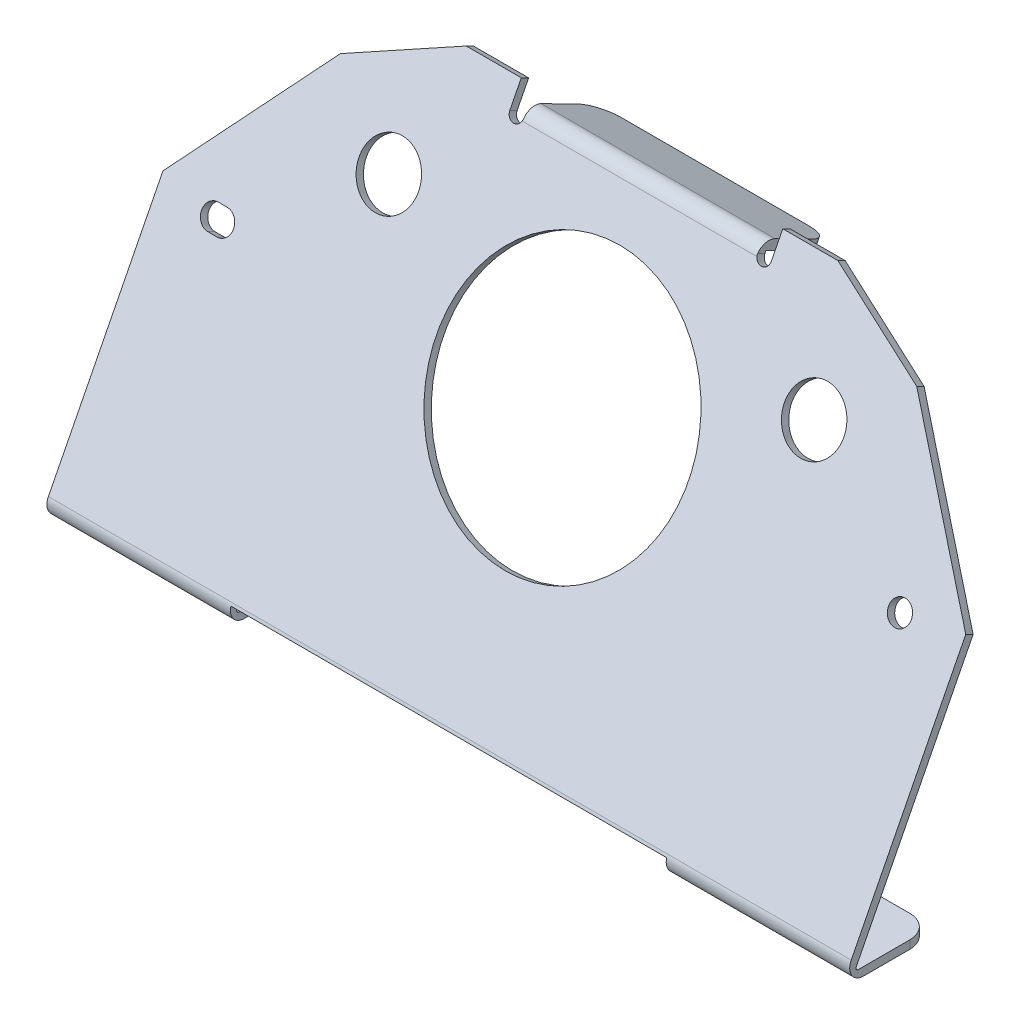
ISO-10303-21;
HEADER;
FILE_DESCRIPTION(('STEP AP214'),'2;1');
FILE_NAME('part.step','',(''),(''),'','','');
FILE_SCHEMA(('AUTOMOTIVE_DESIGN { 1 0 10303 214 1 1 1 1 }'));
ENDSEC;
DATA;
#1=APPLICATION_CONTEXT('core data for automotive mechanical design processes');
#2=APPLICATION_PROTOCOL_DEFINITION('international standard','automotive_design',2000,#1);
#3=PRODUCT_CONTEXT('',#1,'mechanical');
#4=PRODUCT('Part','Part','',(#3));
#5=PRODUCT_RELATED_PRODUCT_CATEGORY('part','',(#4));
#6=PRODUCT_DEFINITION_FORMATION('','',#4);
#7=PRODUCT_DEFINITION_CONTEXT('part definition',#1,'design');
#8=PRODUCT_DEFINITION('design','',#6,#7);
#9=PRODUCT_DEFINITION_SHAPE('','',#8);
#10=(LENGTH_UNIT() NAMED_UNIT(*) SI_UNIT(.MILLI.,.METRE.));
#11=(NAMED_UNIT(*) PLANE_ANGLE_UNIT() SI_UNIT($,.RADIAN.));
#12=(NAMED_UNIT(*) SI_UNIT($,.STERADIAN.) SOLID_ANGLE_UNIT());
#13=UNCERTAINTY_MEASURE_WITH_UNIT(LENGTH_MEASURE(1.E-05),#10,'distance_accuracy_value','');
#14=(GEOMETRIC_REPRESENTATION_CONTEXT(3) GLOBAL_UNCERTAINTY_ASSIGNED_CONTEXT((#13)) GLOBAL_UNIT_ASSIGNED_CONTEXT((#10,
#11,#12)) REPRESENTATION_CONTEXT('',''));
#15=CARTESIAN_POINT('',(0.,0.,0.));
#16=DIRECTION('',(0.,0.,1.));
#17=DIRECTION('',(1.,0.,0.));
#18=AXIS2_PLACEMENT_3D('',#15,#16,#17);
#19=CARTESIAN_POINT('',(175.,90.8826654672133,-26.3070309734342));
#20=DIRECTION('',(0.,-0.891006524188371,0.45399049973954));
#21=DIRECTION('',(0.,-0.45399049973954,-0.891006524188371));
#22=AXIS2_PLACEMENT_3D('',#19,#20,#21);
#23=PLANE('',#22);
#24=DIRECTION('',(-1.,0.,0.));
#25=VECTOR('',#24,1.);
#26=CARTESIAN_POINT('',(175.,90.8826654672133,-26.3070309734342));
#27=LINE('',#26,#25);
#28=CARTESIAN_POINT('',(59.,90.8826654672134,-26.3070309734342));
#29=VERTEX_POINT('',#28);
#30=CARTESIAN_POINT('',(47.,90.8826654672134,-26.3070309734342));
#31=VERTEX_POINT('',#30);
#32=EDGE_CURVE('E495',#29,#31,#27,.T.);
#33=ORIENTED_EDGE('',*,*,#32,.F.);
#34=DIRECTION('',(0.,-0.45399049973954,-0.891006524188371));
#35=VECTOR('',#34,1.);
#36=CARTESIAN_POINT('',(59.,90.8826654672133,-26.3070309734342));
#37=LINE('',#36,#35);
#38=CARTESIAN_POINT('',(59.,90.0654825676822,-27.9108427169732));
#39=VERTEX_POINT('',#38);
#40=EDGE_CURVE('E412',#29,#39,#37,.T.);
#41=ORIENTED_EDGE('',*,*,#40,.T.);
#42=DIRECTION('',(-1.,0.,0.));
#43=VECTOR('',#42,1.);
#44=CARTESIAN_POINT('',(175.,90.0654825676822,-27.9108427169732));
#45=LINE('',#44,#43);
#46=CARTESIAN_POINT('',(47.,90.0654825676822,-27.9108427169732));
#47=VERTEX_POINT('',#46);
#48=EDGE_CURVE('E499',#39,#47,#45,.T.);
#49=ORIENTED_EDGE('',*,*,#48,.T.);
#50=DIRECTION('',(0.,0.453990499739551,0.891006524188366));
#51=VECTOR('',#50,1.);
#52=CARTESIAN_POINT('',(47.,11.434328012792,-182.233172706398));
#53=LINE('',#52,#51);
#54=EDGE_CURVE('E428',#47,#31,#53,.T.);
#55=ORIENTED_EDGE('',*,*,#54,.T.);
#56=EDGE_LOOP('',(#33,#41,#49,#55));
#57=FACE_BOUND('',#56,.T.);
#58=ADVANCED_FACE('F35',(#57),#23,.F.);
#59=CARTESIAN_POINT('',(175.,1.8,0.));
#60=DIRECTION('',(0.,0.,1.));
#61=DIRECTION('',(1.,0.,0.));
#62=AXIS2_PLACEMENT_3D('',#59,#60,#61);
#63=PLANE('',#62);
#64=DIRECTION('',(-1.,0.,0.));
#65=VECTOR('',#64,1.);
#66=CARTESIAN_POINT('',(175.,0.,0.));
#67=LINE('',#66,#65);
#68=CARTESIAN_POINT('',(170.,0.,0.));
#69=VERTEX_POINT('',#68);
#70=CARTESIAN_POINT('',(140.,0.,0.));
#71=VERTEX_POINT('',#70);
#72=EDGE_CURVE('E492',#69,#71,#67,.T.);
#73=ORIENTED_EDGE('',*,*,#72,.T.);
#74=DIRECTION('',(0.,1.,0.));
#75=VECTOR('',#74,1.);
#76=CARTESIAN_POINT('',(140.,1.8,0.));
#77=LINE('',#76,#75);
#78=CARTESIAN_POINT('',(140.,1.8,0.));
#79=VERTEX_POINT('',#78);
#80=EDGE_CURVE('E544',#71,#79,#77,.T.);
#81=ORIENTED_EDGE('',*,*,#80,.T.);
#82=DIRECTION('',(-1.,0.,0.));
#83=VECTOR('',#82,1.);
#84=CARTESIAN_POINT('',(175.,1.8,0.));
#85=LINE('',#84,#83);
#86=CARTESIAN_POINT('',(170.,1.8,0.));
#87=VERTEX_POINT('',#86);
#88=EDGE_CURVE('E504',#87,#79,#85,.T.);
#89=ORIENTED_EDGE('',*,*,#88,.F.);
#90=DIRECTION('',(0.,1.,0.));
#91=VECTOR('',#90,1.);
#92=CARTESIAN_POINT('',(170.,1.8,0.));
#93=LINE('',#92,#91);
#94=EDGE_CURVE('E542',#87,#69,#93,.F.);
#95=ORIENTED_EDGE('',*,*,#94,.T.);
#96=EDGE_LOOP('',(#73,#81,#89,#95));
#97=FACE_BOUND('',#96,.T.);
#98=ADVANCED_FACE('F727',(#97),#63,.F.);
#99=CARTESIAN_POINT('',(175.,1.8,0.));
#100=DIRECTION('',(0.,-1.,0.));
#101=DIRECTION('',(0.,0.,-1.));
#102=AXIS2_PLACEMENT_3D('',#99,#100,#101);
#103=PLANE('',#102);
#104=CARTESIAN_POINT('',(155.,1.8,8.34979573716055));
#105=DIRECTION('',(0.,1.,0.));
#106=DIRECTION('',(0.,0.,1.));
#107=AXIS2_PLACEMENT_3D('',#104,#105,#106);
#108=CIRCLE('',#107,4.99999999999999);
#109=CARTESIAN_POINT('',(155.,1.8,13.3497957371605));
#110=VERTEX_POINT('',#109);
#111=EDGE_CURVE('E453',#110,#110,#108,.T.);
#112=ORIENTED_EDGE('',*,*,#111,.F.);
#113=EDGE_LOOP('',(#112));
#114=FACE_BOUND('',#113,.T.);
#115=DIRECTION('',(0.,0.,-1.));
#116=VECTOR('',#115,1.);
#117=CARTESIAN_POINT('',(135.,1.8,17.0626669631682));
#118=LINE('',#117,#116);
#119=CARTESIAN_POINT('',(135.,1.8,16.2467411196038));
#120=VERTEX_POINT('',#119);
#121=CARTESIAN_POINT('',(135.,1.8,5.));
#122=VERTEX_POINT('',#121);
#123=EDGE_CURVE('E461',#120,#122,#118,.T.);
#124=ORIENTED_EDGE('',*,*,#123,.F.);
#125=DIRECTION('',(-1.,0.,0.));
#126=VECTOR('',#125,1.);
#127=CARTESIAN_POINT('',(175.,1.8,16.2467411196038));
#128=LINE('',#127,#126);
#129=CARTESIAN_POINT('',(175.,1.8,16.2467411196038));
#130=VERTEX_POINT('',#129);
#131=EDGE_CURVE('E670',#120,#130,#128,.F.);
#132=ORIENTED_EDGE('',*,*,#131,.T.);
#133=DIRECTION('',(0.,0.,1.));
#134=VECTOR('',#133,1.);
#135=CARTESIAN_POINT('',(175.,1.8,0.));
#136=LINE('',#135,#134);
#137=CARTESIAN_POINT('',(175.,1.8,5.));
#138=VERTEX_POINT('',#137);
#139=EDGE_CURVE('E472',#138,#130,#136,.T.);
#140=ORIENTED_EDGE('',*,*,#139,.F.);
#141=CARTESIAN_POINT('',(170.,1.8,5.));
#142=DIRECTION('',(0.,-1.,0.));
#143=DIRECTION('',(0.,0.,-1.));
#144=AXIS2_PLACEMENT_3D('',#141,#142,#143);
#145=CIRCLE('',#144,5.);
#146=EDGE_CURVE('E547',#138,#87,#145,.F.);
#147=ORIENTED_EDGE('',*,*,#146,.T.);
#148=ORIENTED_EDGE('',*,*,#88,.T.);
#149=CARTESIAN_POINT('',(140.,1.8,5.));
#150=DIRECTION('',(0.,-1.,0.));
#151=DIRECTION('',(0.,0.,-1.));
#152=AXIS2_PLACEMENT_3D('',#149,#150,#151);
#153=CIRCLE('',#152,5.);
#154=EDGE_CURVE('E549',#79,#122,#153,.F.);
#155=ORIENTED_EDGE('',*,*,#154,.T.);
#156=EDGE_LOOP('',(#124,#132,#140,#147,#148,#155));
#157=FACE_BOUND('',#156,.T.);
#158=ADVANCED_FACE('F683',(#114,#157),#103,.F.);
#159=CARTESIAN_POINT('',(175.,0.,0.));
#160=DIRECTION('',(0.,1.,0.));
#161=DIRECTION('',(0.,0.,1.));
#162=AXIS2_PLACEMENT_3D('',#159,#160,#161);
#163=PLANE('',#162);
#164=CARTESIAN_POINT('',(155.,0.,8.34979573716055));
#165=DIRECTION('',(0.,1.,0.));
#166=DIRECTION('',(0.,0.,1.));
#167=AXIS2_PLACEMENT_3D('',#164,#165,#166);
#168=CIRCLE('',#167,4.99999999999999);
#169=CARTESIAN_POINT('',(155.,0.,13.3497957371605));
#170=VERTEX_POINT('',#169);
#171=EDGE_CURVE('E456',#170,#170,#168,.T.);
#172=ORIENTED_EDGE('',*,*,#171,.T.);
#173=EDGE_LOOP('',(#172));
#174=FACE_BOUND('',#173,.T.);
#175=DIRECTION('',(0.,0.,-1.));
#176=VECTOR('',#175,1.);
#177=CARTESIAN_POINT('',(135.,0.,0.));
#178=LINE('',#177,#176);
#179=CARTESIAN_POINT('',(135.,0.,15.1044449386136));
#180=VERTEX_POINT('',#179);
#181=CARTESIAN_POINT('',(135.,0.,5.));
#182=VERTEX_POINT('',#181);
#183=EDGE_CURVE('E468',#180,#182,#178,.T.);
#184=ORIENTED_EDGE('',*,*,#183,.T.);
#185=CARTESIAN_POINT('',(140.,0.,5.));
#186=DIRECTION('',(0.,1.,0.));
#187=DIRECTION('',(0.,0.,1.));
#188=AXIS2_PLACEMENT_3D('',#185,#186,#187);
#189=CIRCLE('',#188,5.);
#190=EDGE_CURVE('E556',#182,#71,#189,.F.);
#191=ORIENTED_EDGE('',*,*,#190,.T.);
#192=ORIENTED_EDGE('',*,*,#72,.F.);
#193=CARTESIAN_POINT('',(170.,0.,5.));
#194=DIRECTION('',(0.,1.,0.));
#195=DIRECTION('',(0.,0.,1.));
#196=AXIS2_PLACEMENT_3D('',#193,#194,#195);
#197=CIRCLE('',#196,5.);
#198=CARTESIAN_POINT('',(175.,0.,5.));
#199=VERTEX_POINT('',#198);
#200=EDGE_CURVE('E554',#69,#199,#197,.F.);
#201=ORIENTED_EDGE('',*,*,#200,.T.);
#202=DIRECTION('',(0.,0.,-1.));
#203=VECTOR('',#202,1.);
#204=CARTESIAN_POINT('',(175.,0.,0.));
#205=LINE('',#204,#203);
#206=CARTESIAN_POINT('',(175.,0.,15.1044449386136));
#207=VERTEX_POINT('',#206);
#208=EDGE_CURVE('E480',#207,#199,#205,.T.);
#209=ORIENTED_EDGE('',*,*,#208,.F.);
#210=DIRECTION('',(-1.,0.,0.));
#211=VECTOR('',#210,1.);
#212=CARTESIAN_POINT('',(175.,0.,15.1044449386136));
#213=LINE('',#212,#211);
#214=EDGE_CURVE('E508',#207,#180,#213,.T.);
#215=ORIENTED_EDGE('',*,*,#214,.T.);
#216=EDGE_LOOP('',(#184,#191,#192,#201,#209,#215));
#217=FACE_BOUND('',#216,.T.);
#218=ADVANCED_FACE('F717',(#174,#217),#163,.F.);
#219=CARTESIAN_POINT('',(35.,0.,0.));
#220=VERTEX_POINT('',#219);
#221=CARTESIAN_POINT('',(5.,0.,0.));
#222=VERTEX_POINT('',#221);
#223=EDGE_CURVE('E483',#220,#222,#67,.T.);
#224=ORIENTED_EDGE('',*,*,#223,.T.);
#225=DIRECTION('',(0.,1.,0.));
#226=VECTOR('',#225,1.);
#227=CARTESIAN_POINT('',(5.,1.8,0.));
#228=LINE('',#227,#226);
#229=CARTESIAN_POINT('',(5.,1.8,0.));
#230=VERTEX_POINT('',#229);
#231=EDGE_CURVE('E526',#222,#230,#228,.T.);
#232=ORIENTED_EDGE('',*,*,#231,.T.);
#233=CARTESIAN_POINT('',(35.,1.8,0.));
#234=VERTEX_POINT('',#233);
#235=EDGE_CURVE('E503',#234,#230,#85,.T.);
#236=ORIENTED_EDGE('',*,*,#235,.F.);
#237=DIRECTION('',(0.,1.,0.));
#238=VECTOR('',#237,1.);
#239=CARTESIAN_POINT('',(35.,1.8,0.));
#240=LINE('',#239,#238);
#241=EDGE_CURVE('E524',#234,#220,#240,.F.);
#242=ORIENTED_EDGE('',*,*,#241,.T.);
#243=EDGE_LOOP('',(#224,#232,#236,#242));
#244=FACE_BOUND('',#243,.T.);
#245=ADVANCED_FACE('F763',(#244),#63,.F.);
#246=CARTESIAN_POINT('',(20.,1.8,8.34979573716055));
#247=DIRECTION('',(0.,1.,0.));
#248=DIRECTION('',(0.,0.,1.));
#249=AXIS2_PLACEMENT_3D('',#246,#247,#248);
#250=CIRCLE('',#249,5.);
#251=CARTESIAN_POINT('',(20.,1.8,13.3497957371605));
#252=VERTEX_POINT('',#251);
#253=EDGE_CURVE('E457',#252,#252,#250,.T.);
#254=ORIENTED_EDGE('',*,*,#253,.F.);
#255=EDGE_LOOP('',(#254));
#256=FACE_BOUND('',#255,.T.);
#257=DIRECTION('',(0.,0.,1.));
#258=VECTOR('',#257,1.);
#259=CARTESIAN_POINT('',(0.,1.8,0.));
#260=LINE('',#259,#258);
#261=CARTESIAN_POINT('',(0.,1.8,5.));
#262=VERTEX_POINT('',#261);
#263=CARTESIAN_POINT('',(0.,1.8,16.2467411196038));
#264=VERTEX_POINT('',#263);
#265=EDGE_CURVE('E471',#262,#264,#260,.T.);
#266=ORIENTED_EDGE('',*,*,#265,.T.);
#267=DIRECTION('',(-1.,0.,0.));
#268=VECTOR('',#267,1.);
#269=CARTESIAN_POINT('',(40.,1.8,16.2467411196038));
#270=LINE('',#269,#268);
#271=CARTESIAN_POINT('',(40.,1.8,16.2467411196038));
#272=VERTEX_POINT('',#271);
#273=EDGE_CURVE('E668',#264,#272,#270,.F.);
#274=ORIENTED_EDGE('',*,*,#273,.T.);
#275=DIRECTION('',(0.,0.,1.));
#276=VECTOR('',#275,1.);
#277=CARTESIAN_POINT('',(40.,1.8,17.0626669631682));
#278=LINE('',#277,#276);
#279=CARTESIAN_POINT('',(40.,1.8,5.));
#280=VERTEX_POINT('',#279);
#281=EDGE_CURVE('E463',#280,#272,#278,.T.);
#282=ORIENTED_EDGE('',*,*,#281,.F.);
#283=CARTESIAN_POINT('',(35.,1.8,5.));
#284=DIRECTION('',(0.,-1.,0.));
#285=DIRECTION('',(0.,0.,-1.));
#286=AXIS2_PLACEMENT_3D('',#283,#284,#285);
#287=CIRCLE('',#286,5.);
#288=EDGE_CURVE('E529',#280,#234,#287,.F.);
#289=ORIENTED_EDGE('',*,*,#288,.T.);
#290=ORIENTED_EDGE('',*,*,#235,.T.);
#291=CARTESIAN_POINT('',(5.,1.8,5.));
#292=DIRECTION('',(0.,-1.,0.));
#293=DIRECTION('',(0.,0.,-1.));
#294=AXIS2_PLACEMENT_3D('',#291,#292,#293);
#295=CIRCLE('',#294,5.);
#296=EDGE_CURVE('E531',#230,#262,#295,.F.);
#297=ORIENTED_EDGE('',*,*,#296,.T.);
#298=EDGE_LOOP('',(#266,#274,#282,#289,#290,#297));
#299=FACE_BOUND('',#298,.T.);
#300=ADVANCED_FACE('F753',(#256,#299),#103,.F.);
#301=CARTESIAN_POINT('',(175.,1.8,17.0626669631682));
#302=DIRECTION('',(0.,0.453990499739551,0.891006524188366));
#303=DIRECTION('',(0.,-0.891006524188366,0.453990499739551));
#304=AXIS2_PLACEMENT_3D('',#301,#302,#303);
#305=PLANE('',#304);
#306=DIRECTION('',(-1.,0.,0.));
#307=VECTOR('',#306,1.);
#308=CARTESIAN_POINT('',(175.,52.6392480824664,-8.84122376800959));
#309=LINE('',#308,#307);
#310=CARTESIAN_POINT('',(14.,52.6392480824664,-8.84122376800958));
#311=VERTEX_POINT('',#310);
#312=CARTESIAN_POINT('',(12.,52.6392480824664,-8.84122376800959));
#313=VERTEX_POINT('',#312);
#314=EDGE_CURVE('E334',#311,#313,#309,.T.);
#315=ORIENTED_EDGE('',*,*,#314,.T.);
#316=CARTESIAN_POINT('',(12.,50.4117317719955,-7.7062475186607));
#317=DIRECTION('',(0.,0.453990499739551,0.891006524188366));
#318=DIRECTION('',(0.,-0.891006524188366,0.453990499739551));
#319=AXIS2_PLACEMENT_3D('',#316,#317,#318);
#320=CIRCLE('',#319,2.5);
#321=CARTESIAN_POINT('',(12.,48.1842154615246,-6.57127126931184));
#322=VERTEX_POINT('',#321);
#323=EDGE_CURVE('E337',#313,#322,#320,.T.);
#324=ORIENTED_EDGE('',*,*,#323,.T.);
#325=DIRECTION('',(1.,0.,0.));
#326=VECTOR('',#325,1.);
#327=CARTESIAN_POINT('',(175.,48.1842154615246,-6.57127126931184));
#328=LINE('',#327,#326);
#329=CARTESIAN_POINT('',(14.,48.1842154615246,-6.57127126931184));
#330=VERTEX_POINT('',#329);
#331=EDGE_CURVE('E329',#322,#330,#328,.T.);
#332=ORIENTED_EDGE('',*,*,#331,.T.);
#333=CARTESIAN_POINT('',(14.,50.4117317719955,-7.7062475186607));
#334=DIRECTION('',(0.,0.453990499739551,0.891006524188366));
#335=DIRECTION('',(0.,-0.891006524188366,0.453990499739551));
#336=AXIS2_PLACEMENT_3D('',#333,#334,#335);
#337=CIRCLE('',#336,2.5);
#338=EDGE_CURVE('E309',#330,#311,#337,.T.);
#339=ORIENTED_EDGE('',*,*,#338,.T.);
#340=EDGE_LOOP('',(#315,#324,#332,#339));
#341=FACE_BOUND('',#340,.T.);
#342=CARTESIAN_POINT('',(161.7,50.5008324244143,-7.75164656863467));
#343=DIRECTION('',(0.,0.453990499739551,0.891006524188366));
#344=DIRECTION('',(0.,-0.891006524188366,0.453990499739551));
#345=AXIS2_PLACEMENT_3D('',#342,#343,#344);
#346=CIRCLE('',#345,2.5);
#347=CARTESIAN_POINT('',(161.7,48.2733161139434,-6.61667031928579));
#348=VERTEX_POINT('',#347);
#349=EDGE_CURVE('E343',#348,#348,#346,.T.);
#350=ORIENTED_EDGE('',*,*,#349,.T.);
#351=EDGE_LOOP('',(#350));
#352=FACE_BOUND('',#351,.T.);
#353=CARTESIAN_POINT('',(133.859192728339,68.4410479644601,-16.8926429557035));
#354=DIRECTION('',(0.,0.453990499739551,0.891006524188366));
#355=DIRECTION('',(0.,-0.891006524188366,0.453990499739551));
#356=AXIS2_PLACEMENT_3D('',#353,#354,#355);
#357=CIRCLE('',#356,6.50000000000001);
#358=CARTESIAN_POINT('',(133.859192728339,62.6495055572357,-13.9417047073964));
#359=VERTEX_POINT('',#358);
#360=EDGE_CURVE('E379',#359,#359,#357,.T.);
#361=ORIENTED_EDGE('',*,*,#360,.T.);
#362=EDGE_LOOP('',(#361));
#363=FACE_BOUND('',#362,.T.);
#364=CARTESIAN_POINT('',(41.1408072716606,68.4410479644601,-16.8926429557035));
#365=DIRECTION('',(0.,0.453990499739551,0.891006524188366));
#366=DIRECTION('',(0.,-0.891006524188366,0.453990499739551));
#367=AXIS2_PLACEMENT_3D('',#364,#365,#366);
#368=CIRCLE('',#367,6.50000000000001);
#369=CARTESIAN_POINT('',(41.1408072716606,62.6495055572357,-13.9417047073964));
#370=VERTEX_POINT('',#369);
#371=EDGE_CURVE('E385',#370,#370,#368,.T.);
#372=ORIENTED_EDGE('',*,*,#371,.T.);
#373=EDGE_LOOP('',(#372));
#374=FACE_BOUND('',#373,.T.);
#375=CARTESIAN_POINT('',(87.5,51.7522020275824,-8.38925122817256));
#376=DIRECTION('',(0.,0.453990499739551,0.891006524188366));
#377=DIRECTION('',(0.,-0.891006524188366,0.453990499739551));
#378=AXIS2_PLACEMENT_3D('',#375,#376,#377);
#379=CIRCLE('',#378,27.5);
#380=CARTESIAN_POINT('',(87.5,27.2495226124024,4.09548751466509));
#381=VERTEX_POINT('',#380);
#382=EDGE_CURVE('E391',#381,#381,#379,.T.);
#383=ORIENTED_EDGE('',*,*,#382,.T.);
#384=EDGE_LOOP('',(#383));
#385=FACE_BOUND('',#384,.T.);
#386=DIRECTION('',(0.,-0.891006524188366,0.453990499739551));
#387=VECTOR('',#386,1.);
#388=CARTESIAN_POINT('',(40.,1.8,17.0626669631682));
#389=LINE('',#388,#387);
#390=CARTESIAN_POINT('',(40.,3.8,16.0436160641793));
#391=VERTEX_POINT('',#390);
#392=CARTESIAN_POINT('',(40.,2.52699524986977,16.692244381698));
#393=VERTEX_POINT('',#392);
#394=EDGE_CURVE('E354',#391,#393,#389,.T.);
#395=ORIENTED_EDGE('',*,*,#394,.T.);
#396=DIRECTION('',(-1.,0.,0.));
#397=VECTOR('',#396,1.);
#398=CARTESIAN_POINT('',(0.,2.52699524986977,16.692244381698));
#399=LINE('',#398,#397);
#400=CARTESIAN_POINT('',(0.,2.52699524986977,16.692244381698));
#401=VERTEX_POINT('',#400);
#402=EDGE_CURVE('E665',#393,#401,#399,.T.);
#403=ORIENTED_EDGE('',*,*,#402,.T.);
#404=DIRECTION('',(0.,0.891006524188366,-0.453990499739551));
#405=VECTOR('',#404,1.);
#406=CARTESIAN_POINT('',(0.,1.8,17.0626669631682));
#407=LINE('',#406,#405);
#408=CARTESIAN_POINT('',(0.,52.5501474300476,-8.79582471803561));
#409=VERTEX_POINT('',#408);
#410=EDGE_CURVE('E486',#401,#409,#407,.T.);
#411=ORIENTED_EDGE('',*,*,#410,.T.);
#412=DIRECTION('',(0.624862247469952,0.695639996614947,-0.354446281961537));
#413=VECTOR('',#412,1.);
#414=CARTESIAN_POINT('',(40.5420715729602,97.6843936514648,-31.7928718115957));
#415=LINE('',#414,#413);
#416=CARTESIAN_POINT('',(24.6820587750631,80.0279272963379,-22.7964528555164));
#417=VERTEX_POINT('',#416);
#418=EDGE_CURVE('E431',#409,#417,#415,.T.);
#419=ORIENTED_EDGE('',*,*,#418,.T.);
#420=DIRECTION('',(0.892717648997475,0.401502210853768,-0.204575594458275));
#421=VECTOR('',#420,1.);
#422=CARTESIAN_POINT('',(109.158671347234,118.02151547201,-42.155152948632));
#423=LINE('',#422,#421);
#424=EDGE_CURVE('E435',#417,#47,#423,.T.);
#425=ORIENTED_EDGE('',*,*,#424,.T.);
#426=ORIENTED_EDGE('',*,*,#48,.F.);
#427=DIRECTION('',(0.,-0.891006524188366,0.453990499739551));
#428=VECTOR('',#427,1.);
#429=CARTESIAN_POINT('',(59.,1.8,17.0626669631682));
#430=LINE('',#429,#428);
#431=CARTESIAN_POINT('',(59.,85.1649466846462,-25.4138949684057));
#432=VERTEX_POINT('',#431);
#433=EDGE_CURVE('E409',#39,#432,#430,.T.);
#434=ORIENTED_EDGE('',*,*,#433,.T.);
#435=CARTESIAN_POINT('',(60.5,85.1649466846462,-25.4138949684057));
#436=DIRECTION('',(0.,0.453990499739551,0.891006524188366));
#437=DIRECTION('',(0.,-0.891006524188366,0.453990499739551));
#438=AXIS2_PLACEMENT_3D('',#435,#436,#437);
#439=CIRCLE('',#438,1.5);
#440=CARTESIAN_POINT('',(60.5,83.8284368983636,-24.7329092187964));
#441=VERTEX_POINT('',#440);
#442=EDGE_CURVE('E615',#432,#441,#439,.T.);
#443=ORIENTED_EDGE('',*,*,#442,.T.);
#444=CARTESIAN_POINT('',(60.5,85.1649466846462,-25.4138949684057));
#445=DIRECTION('',(0.,0.453990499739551,0.891006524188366));
#446=DIRECTION('',(0.,-0.891006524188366,0.453990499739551));
#447=AXIS2_PLACEMENT_3D('',#444,#445,#446);
#448=CIRCLE('',#447,1.5);
#449=CARTESIAN_POINT('',(62.,85.1649466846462,-25.4138949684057));
#450=VERTEX_POINT('',#449);
#451=EDGE_CURVE('E611',#441,#450,#448,.T.);
#452=ORIENTED_EDGE('',*,*,#451,.T.);
#453=DIRECTION('',(0.,0.891006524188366,-0.453990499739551));
#454=VECTOR('',#453,1.);
#455=CARTESIAN_POINT('',(62.,1.8,17.0626669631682));
#456=LINE('',#455,#454);
#457=CARTESIAN_POINT('',(62.,85.6104499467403,-25.6408902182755));
#458=VERTEX_POINT('',#457);
#459=EDGE_CURVE('E407',#450,#458,#456,.T.);
#460=ORIENTED_EDGE('',*,*,#459,.T.);
#461=DIRECTION('',(1.,0.,0.));
#462=VECTOR('',#461,1.);
#463=CARTESIAN_POINT('',(175.,85.6104499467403,-25.6408902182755));
#464=LINE('',#463,#462);
#465=CARTESIAN_POINT('',(113.,85.6104499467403,-25.6408902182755));
#466=VERTEX_POINT('',#465);
#467=EDGE_CURVE('E371',#458,#466,#464,.T.);
#468=ORIENTED_EDGE('',*,*,#467,.T.);
#469=DIRECTION('',(0.,-0.891006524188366,0.453990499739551));
#470=VECTOR('',#469,1.);
#471=CARTESIAN_POINT('',(113.,1.8,17.0626669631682));
#472=LINE('',#471,#470);
#473=CARTESIAN_POINT('',(113.,85.1649466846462,-25.4138949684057));
#474=VERTEX_POINT('',#473);
#475=EDGE_CURVE('E396',#466,#474,#472,.T.);
#476=ORIENTED_EDGE('',*,*,#475,.T.);
#477=CARTESIAN_POINT('',(114.5,85.1649466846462,-25.4138949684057));
#478=DIRECTION('',(0.,0.453990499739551,0.891006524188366));
#479=DIRECTION('',(0.,-0.891006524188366,0.453990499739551));
#480=AXIS2_PLACEMENT_3D('',#477,#478,#479);
#481=CIRCLE('',#480,1.5);
#482=CARTESIAN_POINT('',(114.5,83.8284368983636,-24.7329092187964));
#483=VERTEX_POINT('',#482);
#484=EDGE_CURVE('E600',#474,#483,#481,.T.);
#485=ORIENTED_EDGE('',*,*,#484,.T.);
#486=CARTESIAN_POINT('',(114.5,85.1649466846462,-25.4138949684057));
#487=DIRECTION('',(0.,0.453990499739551,0.891006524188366));
#488=DIRECTION('',(0.,-0.891006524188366,0.453990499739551));
#489=AXIS2_PLACEMENT_3D('',#486,#487,#488);
#490=CIRCLE('',#489,1.5);
#491=CARTESIAN_POINT('',(116.,85.1649466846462,-25.4138949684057));
#492=VERTEX_POINT('',#491);
#493=EDGE_CURVE('E595',#483,#492,#490,.T.);
#494=ORIENTED_EDGE('',*,*,#493,.T.);
#495=DIRECTION('',(0.,0.891006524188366,-0.453990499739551));
#496=VECTOR('',#495,1.);
#497=CARTESIAN_POINT('',(116.,1.8,17.0626669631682));
#498=LINE('',#497,#496);
#499=CARTESIAN_POINT('',(116.,90.0654825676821,-27.9108427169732));
#500=VERTEX_POINT('',#499);
#501=EDGE_CURVE('E402',#492,#500,#498,.T.);
#502=ORIENTED_EDGE('',*,*,#501,.T.);
#503=CARTESIAN_POINT('',(128.,90.0654825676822,-27.9108427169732));
#504=VERTEX_POINT('',#503);
#505=EDGE_CURVE('E500',#504,#500,#45,.T.);
#506=ORIENTED_EDGE('',*,*,#505,.F.);
#507=DIRECTION('',(0.892717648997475,-0.401502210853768,0.204575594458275));
#508=VECTOR('',#507,1.);
#509=CARTESIAN_POINT('',(205.306668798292,55.2965962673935,-10.1952102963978));
#510=LINE('',#509,#508);
#511=CARTESIAN_POINT('',(150.317941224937,80.027927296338,-22.7964528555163));
#512=VERTEX_POINT('',#511);
#513=EDGE_CURVE('E450',#504,#512,#510,.T.);
#514=ORIENTED_EDGE('',*,*,#513,.T.);
#515=DIRECTION('',(0.624862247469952,-0.695639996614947,0.354446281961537));
#516=VECTOR('',#515,1.);
#517=CARTESIAN_POINT('',(202.78717338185,21.6155386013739,6.9661457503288));
#518=LINE('',#517,#516);
#519=CARTESIAN_POINT('',(175.,52.5501474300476,-8.79582471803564));
#520=VERTEX_POINT('',#519);
#521=EDGE_CURVE('E446',#512,#520,#518,.T.);
#522=ORIENTED_EDGE('',*,*,#521,.T.);
#523=DIRECTION('',(0.,0.891006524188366,-0.453990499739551));
#524=VECTOR('',#523,1.);
#525=CARTESIAN_POINT('',(175.,1.8,17.0626669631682));
#526=LINE('',#525,#524);
#527=CARTESIAN_POINT('',(175.,2.52699524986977,16.692244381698));
#528=VERTEX_POINT('',#527);
#529=EDGE_CURVE('E475',#528,#520,#526,.T.);
#530=ORIENTED_EDGE('',*,*,#529,.F.);
#531=DIRECTION('',(-1.,0.,0.));
#532=VECTOR('',#531,1.);
#533=CARTESIAN_POINT('',(135.,2.52699524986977,16.692244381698));
#534=LINE('',#533,#532);
#535=CARTESIAN_POINT('',(135.,2.52699524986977,16.692244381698));
#536=VERTEX_POINT('',#535);
#537=EDGE_CURVE('E662',#528,#536,#534,.T.);
#538=ORIENTED_EDGE('',*,*,#537,.T.);
#539=DIRECTION('',(0.,0.891006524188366,-0.453990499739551));
#540=VECTOR('',#539,1.);
#541=CARTESIAN_POINT('',(135.,1.8,17.0626669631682));
#542=LINE('',#541,#540);
#543=CARTESIAN_POINT('',(135.,3.8,16.0436160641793));
#544=VERTEX_POINT('',#543);
#545=EDGE_CURVE('E350',#536,#544,#542,.T.);
#546=ORIENTED_EDGE('',*,*,#545,.T.);
#547=DIRECTION('',(-1.,0.,0.));
#548=VECTOR('',#547,1.);
#549=CARTESIAN_POINT('',(175.,3.8,16.0436160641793));
#550=LINE('',#549,#548);
#551=EDGE_CURVE('E357',#544,#391,#550,.T.);
#552=ORIENTED_EDGE('',*,*,#551,.T.);
#553=EDGE_LOOP('',(#395,#403,#411,#419,#425,#426,#434,#443,#452,#460,#468,#476,#485,#494,#502,
#506,#514,#522,#530,#538,#546,#552));
#554=FACE_BOUND('',#553,.T.);
#555=ADVANCED_FACE('F692',(#341,#352,#363,#374,#385,#554),#305,.F.);
#556=ORIENTED_EDGE('',*,*,#505,.T.);
#557=DIRECTION('',(0.,0.45399049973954,0.891006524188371));
#558=VECTOR('',#557,1.);
#559=CARTESIAN_POINT('',(116.,90.8826654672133,-26.3070309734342));
#560=LINE('',#559,#558);
#561=CARTESIAN_POINT('',(116.,90.8826654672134,-26.3070309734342));
#562=VERTEX_POINT('',#561);
#563=EDGE_CURVE('E399',#500,#562,#560,.T.);
#564=ORIENTED_EDGE('',*,*,#563,.T.);
#565=CARTESIAN_POINT('',(128.,90.8826654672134,-26.3070309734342));
#566=VERTEX_POINT('',#565);
#567=EDGE_CURVE('E496',#566,#562,#27,.T.);
#568=ORIENTED_EDGE('',*,*,#567,.F.);
#569=DIRECTION('',(0.,0.453990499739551,0.891006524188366));
#570=VECTOR('',#569,1.);
#571=CARTESIAN_POINT('',(128.,11.434328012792,-182.233172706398));
#572=LINE('',#571,#570);
#573=EDGE_CURVE('E443',#504,#566,#572,.T.);
#574=ORIENTED_EDGE('',*,*,#573,.F.);
#575=EDGE_LOOP('',(#556,#564,#568,#574));
#576=FACE_BOUND('',#575,.T.);
#577=ADVANCED_FACE('F782',(#576),#23,.F.);
#578=CARTESIAN_POINT('',(175.,0.,20.));
#579=DIRECTION('',(0.,-0.453990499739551,-0.891006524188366));
#580=DIRECTION('',(0.,0.891006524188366,-0.453990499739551));
#581=AXIS2_PLACEMENT_3D('',#578,#579,#580);
#582=PLANE('',#581);
#583=DIRECTION('',(1.,0.,0.));
#584=VECTOR('',#583,1.);
#585=CARTESIAN_POINT('',(12.,49.0013983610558,-4.96745952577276));
#586=LINE('',#585,#584);
#587=CARTESIAN_POINT('',(12.,49.0013983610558,-4.96745952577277));
#588=VERTEX_POINT('',#587);
#589=CARTESIAN_POINT('',(14.,49.0013983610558,-4.96745952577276));
#590=VERTEX_POINT('',#589);
#591=EDGE_CURVE('E315',#588,#590,#586,.T.);
#592=ORIENTED_EDGE('',*,*,#591,.F.);
#593=CARTESIAN_POINT('',(12.,51.2289146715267,-6.10243577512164));
#594=DIRECTION('',(0.,0.453990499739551,0.891006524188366));
#595=DIRECTION('',(0.,-0.891006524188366,0.453990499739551));
#596=AXIS2_PLACEMENT_3D('',#593,#594,#595);
#597=CIRCLE('',#596,2.5);
#598=CARTESIAN_POINT('',(12.,53.4564309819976,-7.23741202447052));
#599=VERTEX_POINT('',#598);
#600=EDGE_CURVE('E58',#599,#588,#597,.T.);
#601=ORIENTED_EDGE('',*,*,#600,.F.);
#602=DIRECTION('',(-1.,0.,0.));
#603=VECTOR('',#602,1.);
#604=CARTESIAN_POINT('',(12.,53.4564309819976,-7.23741202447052));
#605=LINE('',#604,#603);
#606=CARTESIAN_POINT('',(14.,53.4564309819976,-7.23741202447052));
#607=VERTEX_POINT('',#606);
#608=EDGE_CURVE('E322',#607,#599,#605,.T.);
#609=ORIENTED_EDGE('',*,*,#608,.F.);
#610=CARTESIAN_POINT('',(14.,51.2289146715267,-6.10243577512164));
#611=DIRECTION('',(0.,0.453990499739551,0.891006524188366));
#612=DIRECTION('',(0.,-0.891006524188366,0.453990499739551));
#613=AXIS2_PLACEMENT_3D('',#610,#611,#612);
#614=CIRCLE('',#613,2.5);
#615=EDGE_CURVE('E306',#590,#607,#614,.T.);
#616=ORIENTED_EDGE('',*,*,#615,.F.);
#617=EDGE_LOOP('',(#592,#601,#609,#616));
#618=FACE_BOUND('',#617,.T.);
#619=CARTESIAN_POINT('',(161.7,51.3180153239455,-6.1478348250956));
#620=DIRECTION('',(0.,0.453990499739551,0.891006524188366));
#621=DIRECTION('',(0.,-0.891006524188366,0.453990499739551));
#622=AXIS2_PLACEMENT_3D('',#619,#620,#621);
#623=CIRCLE('',#622,2.5);
#624=CARTESIAN_POINT('',(161.7,49.0904990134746,-5.01285857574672));
#625=VERTEX_POINT('',#624);
#626=EDGE_CURVE('E340',#625,#625,#623,.T.);
#627=ORIENTED_EDGE('',*,*,#626,.F.);
#628=EDGE_LOOP('',(#627));
#629=FACE_BOUND('',#628,.T.);
#630=CARTESIAN_POINT('',(133.859192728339,69.2582308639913,-15.2888312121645));
#631=DIRECTION('',(0.,0.453990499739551,0.891006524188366));
#632=DIRECTION('',(0.,-0.891006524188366,0.453990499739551));
#633=AXIS2_PLACEMENT_3D('',#630,#631,#632);
#634=CIRCLE('',#633,6.50000000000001);
#635=CARTESIAN_POINT('',(133.859192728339,63.4666884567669,-12.3378929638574));
#636=VERTEX_POINT('',#635);
#637=EDGE_CURVE('E376',#636,#636,#634,.T.);
#638=ORIENTED_EDGE('',*,*,#637,.F.);
#639=EDGE_LOOP('',(#638));
#640=FACE_BOUND('',#639,.T.);
#641=CARTESIAN_POINT('',(41.1408072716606,69.2582308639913,-15.2888312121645));
#642=DIRECTION('',(0.,0.453990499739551,0.891006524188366));
#643=DIRECTION('',(0.,-0.891006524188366,0.453990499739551));
#644=AXIS2_PLACEMENT_3D('',#641,#642,#643);
#645=CIRCLE('',#644,6.50000000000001);
#646=CARTESIAN_POINT('',(41.1408072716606,63.4666884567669,-12.3378929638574));
#647=VERTEX_POINT('',#646);
#648=EDGE_CURVE('E382',#647,#647,#645,.T.);
#649=ORIENTED_EDGE('',*,*,#648,.F.);
#650=EDGE_LOOP('',(#649));
#651=FACE_BOUND('',#650,.T.);
#652=CARTESIAN_POINT('',(87.5,52.5693849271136,-6.78543948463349));
#653=DIRECTION('',(0.,0.453990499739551,0.891006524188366));
#654=DIRECTION('',(0.,-0.891006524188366,0.453990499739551));
#655=AXIS2_PLACEMENT_3D('',#652,#653,#654);
#656=CIRCLE('',#655,27.5);
#657=CARTESIAN_POINT('',(87.5,28.0667055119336,5.69929925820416));
#658=VERTEX_POINT('',#657);
#659=EDGE_CURVE('E388',#658,#658,#656,.T.);
#660=ORIENTED_EDGE('',*,*,#659,.F.);
#661=EDGE_LOOP('',(#660));
#662=FACE_BOUND('',#661,.T.);
#663=CARTESIAN_POINT('',(114.5,85.9821295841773,-23.8100832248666));
#664=DIRECTION('',(0.,-0.453990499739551,-0.891006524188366));
#665=DIRECTION('',(0.,0.891006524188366,-0.453990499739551));
#666=AXIS2_PLACEMENT_3D('',#663,#664,#665);
#667=CIRCLE('',#666,1.5);
#668=CARTESIAN_POINT('',(114.5,84.6456197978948,-23.1290974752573));
#669=VERTEX_POINT('',#668);
#670=CARTESIAN_POINT('',(113.085786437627,85.5366263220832,-23.5830879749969));
#671=VERTEX_POINT('',#670);
#672=EDGE_CURVE('E597',#669,#671,#667,.T.);
#673=ORIENTED_EDGE('',*,*,#672,.T.);
#674=DIRECTION('',(1.,0.,0.));
#675=VECTOR('',#674,1.);
#676=CARTESIAN_POINT('',(175.,85.5366263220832,-23.5830879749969));
#677=LINE('',#676,#675);
#678=CARTESIAN_POINT('',(61.9142135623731,85.5366263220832,-23.5830879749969));
#679=VERTEX_POINT('',#678);
#680=EDGE_CURVE('E632',#671,#679,#677,.F.);
#681=ORIENTED_EDGE('',*,*,#680,.T.);
#682=CARTESIAN_POINT('',(60.5,85.9821295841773,-23.8100832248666));
#683=DIRECTION('',(0.,-0.453990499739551,-0.891006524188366));
#684=DIRECTION('',(0.,0.891006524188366,-0.453990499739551));
#685=AXIS2_PLACEMENT_3D('',#682,#683,#684);
#686=CIRCLE('',#685,1.5);
#687=CARTESIAN_POINT('',(60.5,84.6456197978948,-23.1290974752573));
#688=VERTEX_POINT('',#687);
#689=EDGE_CURVE('E609',#679,#688,#686,.T.);
#690=ORIENTED_EDGE('',*,*,#689,.T.);
#691=CARTESIAN_POINT('',(60.5,85.9821295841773,-23.8100832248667));
#692=DIRECTION('',(0.,-0.453990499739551,-0.891006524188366));
#693=DIRECTION('',(0.,0.891006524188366,-0.453990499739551));
#694=AXIS2_PLACEMENT_3D('',#691,#692,#693);
#695=CIRCLE('',#694,1.5);
#696=CARTESIAN_POINT('',(59.,85.9821295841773,-23.8100832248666));
#697=VERTEX_POINT('',#696);
#698=EDGE_CURVE('E613',#688,#697,#695,.T.);
#699=ORIENTED_EDGE('',*,*,#698,.T.);
#700=DIRECTION('',(0.,-0.891006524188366,0.45399049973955));
#701=VECTOR('',#700,1.);
#702=CARTESIAN_POINT('',(59.,92.7692849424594,-27.2683116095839));
#703=LINE('',#702,#701);
#704=EDGE_CURVE('E404',#29,#697,#703,.T.);
#705=ORIENTED_EDGE('',*,*,#704,.F.);
#706=ORIENTED_EDGE('',*,*,#32,.T.);
#707=DIRECTION('',(0.892717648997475,0.401502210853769,-0.204575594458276));
#708=VECTOR('',#707,1.);
#709=CARTESIAN_POINT('',(24.6820587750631,80.8451101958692,-21.1926411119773));
#710=LINE('',#709,#708);
#711=CARTESIAN_POINT('',(24.6820587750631,80.8451101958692,-21.1926411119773));
#712=VERTEX_POINT('',#711);
#713=EDGE_CURVE('E424',#712,#31,#710,.T.);
#714=ORIENTED_EDGE('',*,*,#713,.F.);
#715=DIRECTION('',(0.624862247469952,0.695639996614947,-0.354446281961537));
#716=VECTOR('',#715,1.);
#717=CARTESIAN_POINT('',(0.,53.3673303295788,-7.19201297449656));
#718=LINE('',#717,#716);
#719=CARTESIAN_POINT('',(0.,53.3673303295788,-7.19201297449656));
#720=VERTEX_POINT('',#719);
#721=EDGE_CURVE('E419',#720,#712,#718,.T.);
#722=ORIENTED_EDGE('',*,*,#721,.F.);
#723=DIRECTION('',(0.,-0.891006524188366,0.453990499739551));
#724=VECTOR('',#723,1.);
#725=CARTESIAN_POINT('',(0.,0.,20.));
#726=LINE('',#725,#724);
#727=CARTESIAN_POINT('',(0.,4.36197149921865,17.7774645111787));
#728=VERTEX_POINT('',#727);
#729=EDGE_CURVE('E488',#720,#728,#726,.T.);
#730=ORIENTED_EDGE('',*,*,#729,.T.);
#731=DIRECTION('',(-1.,0.,0.));
#732=VECTOR('',#731,1.);
#733=CARTESIAN_POINT('',(175.,4.36197149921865,17.7774645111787));
#734=LINE('',#733,#732);
#735=CARTESIAN_POINT('',(175.,4.36197149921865,17.7774645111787));
#736=VERTEX_POINT('',#735);
#737=EDGE_CURVE('E514',#728,#736,#734,.F.);
#738=ORIENTED_EDGE('',*,*,#737,.T.);
#739=DIRECTION('',(0.,-0.891006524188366,0.453990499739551));
#740=VECTOR('',#739,1.);
#741=CARTESIAN_POINT('',(175.,0.,20.));
#742=LINE('',#741,#740);
#743=CARTESIAN_POINT('',(175.,53.3673303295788,-7.19201297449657));
#744=VERTEX_POINT('',#743);
#745=EDGE_CURVE('E478',#744,#736,#742,.T.);
#746=ORIENTED_EDGE('',*,*,#745,.F.);
#747=DIRECTION('',(0.624862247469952,-0.695639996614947,0.354446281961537));
#748=VECTOR('',#747,1.);
#749=CARTESIAN_POINT('',(175.,53.3673303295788,-7.19201297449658));
#750=LINE('',#749,#748);
#751=CARTESIAN_POINT('',(150.317941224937,80.8451101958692,-21.1926411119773));
#752=VERTEX_POINT('',#751);
#753=EDGE_CURVE('E441',#752,#744,#750,.T.);
#754=ORIENTED_EDGE('',*,*,#753,.F.);
#755=DIRECTION('',(0.892717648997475,-0.401502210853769,0.204575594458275));
#756=VECTOR('',#755,1.);
#757=CARTESIAN_POINT('',(150.317941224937,80.8451101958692,-21.1926411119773));
#758=LINE('',#757,#756);
#759=EDGE_CURVE('E438',#566,#752,#758,.T.);
#760=ORIENTED_EDGE('',*,*,#759,.F.);
#761=ORIENTED_EDGE('',*,*,#567,.T.);
#762=DIRECTION('',(0.,0.891006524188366,-0.45399049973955));
#763=VECTOR('',#762,1.);
#764=CARTESIAN_POINT('',(116.,93.1710024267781,-27.4729968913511));
#765=LINE('',#764,#763);
#766=CARTESIAN_POINT('',(116.,85.9821295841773,-23.8100832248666));
#767=VERTEX_POINT('',#766);
#768=EDGE_CURVE('E394',#767,#562,#765,.T.);
#769=ORIENTED_EDGE('',*,*,#768,.F.);
#770=CARTESIAN_POINT('',(114.5,85.9821295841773,-23.8100832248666));
#771=DIRECTION('',(0.,-0.453990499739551,-0.891006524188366));
#772=DIRECTION('',(0.,0.891006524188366,-0.453990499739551));
#773=AXIS2_PLACEMENT_3D('',#770,#771,#772);
#774=CIRCLE('',#773,1.5);
#775=EDGE_CURVE('E593',#767,#669,#774,.T.);
#776=ORIENTED_EDGE('',*,*,#775,.T.);
#777=EDGE_LOOP('',(#673,#681,#690,#699,#705,#706,#714,#722,#730,#738,#746,#754,#760,#761,#769,#776));
#778=FACE_BOUND('',#777,.T.);
#779=ADVANCED_FACE('F319',(#618,#629,#640,#651,#662,#778),#582,.F.);
#780=CARTESIAN_POINT('',(20.,0.,8.34979573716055));
#781=DIRECTION('',(0.,1.,0.));
#782=DIRECTION('',(0.,0.,1.));
#783=AXIS2_PLACEMENT_3D('',#780,#781,#782);
#784=CIRCLE('',#783,5.);
#785=CARTESIAN_POINT('',(20.,0.,13.3497957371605));
#786=VERTEX_POINT('',#785);
#787=EDGE_CURVE('E460',#786,#786,#784,.T.);
#788=ORIENTED_EDGE('',*,*,#787,.T.);
#789=EDGE_LOOP('',(#788));
#790=FACE_BOUND('',#789,.T.);
#791=DIRECTION('',(0.,0.,-1.));
#792=VECTOR('',#791,1.);
#793=CARTESIAN_POINT('',(0.,0.,0.));
#794=LINE('',#793,#792);
#795=CARTESIAN_POINT('',(0.,0.,15.1044449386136));
#796=VERTEX_POINT('',#795);
#797=CARTESIAN_POINT('',(0.,0.,5.));
#798=VERTEX_POINT('',#797);
#799=EDGE_CURVE('E476',#796,#798,#794,.T.);
#800=ORIENTED_EDGE('',*,*,#799,.T.);
#801=CARTESIAN_POINT('',(5.,0.,5.));
#802=DIRECTION('',(0.,1.,0.));
#803=DIRECTION('',(0.,0.,1.));
#804=AXIS2_PLACEMENT_3D('',#801,#802,#803);
#805=CIRCLE('',#804,5.);
#806=EDGE_CURVE('E537',#798,#222,#805,.F.);
#807=ORIENTED_EDGE('',*,*,#806,.T.);
#808=ORIENTED_EDGE('',*,*,#223,.F.);
#809=CARTESIAN_POINT('',(35.,0.,5.));
#810=DIRECTION('',(0.,1.,0.));
#811=DIRECTION('',(0.,0.,1.));
#812=AXIS2_PLACEMENT_3D('',#809,#810,#811);
#813=CIRCLE('',#812,5.);
#814=CARTESIAN_POINT('',(40.,0.,5.));
#815=VERTEX_POINT('',#814);
#816=EDGE_CURVE('E535',#220,#815,#813,.F.);
#817=ORIENTED_EDGE('',*,*,#816,.T.);
#818=DIRECTION('',(0.,0.,1.));
#819=VECTOR('',#818,1.);
#820=CARTESIAN_POINT('',(40.,0.,0.));
#821=LINE('',#820,#819);
#822=CARTESIAN_POINT('',(40.,0.,15.1044449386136));
#823=VERTEX_POINT('',#822);
#824=EDGE_CURVE('E466',#815,#823,#821,.T.);
#825=ORIENTED_EDGE('',*,*,#824,.T.);
#826=EDGE_CURVE('E507',#823,#796,#213,.T.);
#827=ORIENTED_EDGE('',*,*,#826,.T.);
#828=EDGE_LOOP('',(#800,#807,#808,#817,#825,#827));
#829=FACE_BOUND('',#828,.T.);
#830=ADVANCED_FACE('F768',(#790,#829),#163,.F.);
#831=CARTESIAN_POINT('',(175.,0.,0.));
#832=DIRECTION('',(-1.,0.,0.));
#833=DIRECTION('',(0.,0.,1.));
#834=AXIS2_PLACEMENT_3D('',#831,#832,#833);
#835=PLANE('',#834);
#836=ORIENTED_EDGE('',*,*,#139,.T.);
#837=CARTESIAN_POINT('',(175.,2.3,16.2467411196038));
#838=DIRECTION('',(-1.,0.,0.));
#839=DIRECTION('',(0.,0.,1.));
#840=AXIS2_PLACEMENT_3D('',#837,#838,#839);
#841=CIRCLE('',#840,0.5);
#842=EDGE_CURVE('E11',#130,#528,#841,.T.);
#843=ORIENTED_EDGE('',*,*,#842,.T.);
#844=ORIENTED_EDGE('',*,*,#529,.T.);
#845=DIRECTION('',(0.,0.453990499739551,0.891006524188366));
#846=VECTOR('',#845,1.);
#847=CARTESIAN_POINT('',(175.,45.2771603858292,-23.0698654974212));
#848=LINE('',#847,#846);
#849=EDGE_CURVE('E561',#520,#744,#848,.T.);
#850=ORIENTED_EDGE('',*,*,#849,.T.);
#851=ORIENTED_EDGE('',*,*,#745,.T.);
#852=CARTESIAN_POINT('',(175.,3.,15.1044449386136));
#853=DIRECTION('',(-1.,0.,0.));
#854=DIRECTION('',(0.,0.,1.));
#855=AXIS2_PLACEMENT_3D('',#852,#853,#854);
#856=CIRCLE('',#855,3.);
#857=EDGE_CURVE('E517',#736,#207,#856,.F.);
#858=ORIENTED_EDGE('',*,*,#857,.T.);
#859=ORIENTED_EDGE('',*,*,#208,.T.);
#860=DIRECTION('',(0.,1.,0.));
#861=VECTOR('',#860,1.);
#862=CARTESIAN_POINT('',(175.,0.,5.));
#863=LINE('',#862,#861);
#864=EDGE_CURVE('E558',#199,#138,#863,.T.);
#865=ORIENTED_EDGE('',*,*,#864,.T.);
#866=EDGE_LOOP('',(#836,#843,#844,#850,#851,#858,#859,#865));
#867=FACE_BOUND('',#866,.T.);
#868=ADVANCED_FACE('F689',(#867),#835,.F.);
#869=CARTESIAN_POINT('',(0.,0.,0.));
#870=DIRECTION('',(-1.,0.,0.));
#871=DIRECTION('',(0.,0.,1.));
#872=AXIS2_PLACEMENT_3D('',#869,#870,#871);
#873=PLANE('',#872);
#874=DIRECTION('',(0.,0.453990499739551,0.891006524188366));
#875=VECTOR('',#874,1.);
#876=CARTESIAN_POINT('',(0.,45.2771603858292,-23.0698654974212));
#877=LINE('',#876,#875);
#878=EDGE_CURVE('E568',#409,#720,#877,.T.);
#879=ORIENTED_EDGE('',*,*,#878,.F.);
#880=ORIENTED_EDGE('',*,*,#410,.F.);
#881=CARTESIAN_POINT('',(0.,2.3,16.2467411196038));
#882=DIRECTION('',(-1.,0.,0.));
#883=DIRECTION('',(0.,0.,1.));
#884=AXIS2_PLACEMENT_3D('',#881,#882,#883);
#885=CIRCLE('',#884,0.5);
#886=EDGE_CURVE('E672',#401,#264,#885,.F.);
#887=ORIENTED_EDGE('',*,*,#886,.T.);
#888=ORIENTED_EDGE('',*,*,#265,.F.);
#889=DIRECTION('',(0.,1.,0.));
#890=VECTOR('',#889,1.);
#891=CARTESIAN_POINT('',(0.,0.,5.));
#892=LINE('',#891,#890);
#893=EDGE_CURVE('E533',#262,#798,#892,.F.);
#894=ORIENTED_EDGE('',*,*,#893,.T.);
#895=ORIENTED_EDGE('',*,*,#799,.F.);
#896=CARTESIAN_POINT('',(0.,3.,15.1044449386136));
#897=DIRECTION('',(-1.,0.,0.));
#898=DIRECTION('',(0.,0.,1.));
#899=AXIS2_PLACEMENT_3D('',#896,#897,#898);
#900=CIRCLE('',#899,3.);
#901=EDGE_CURVE('E511',#796,#728,#900,.T.);
#902=ORIENTED_EDGE('',*,*,#901,.T.);
#903=ORIENTED_EDGE('',*,*,#729,.F.);
#904=EDGE_LOOP('',(#879,#880,#887,#888,#894,#895,#902,#903));
#905=FACE_BOUND('',#904,.T.);
#906=ADVANCED_FACE('F750',(#905),#873,.T.);
#907=CARTESIAN_POINT('',(175.,3.,15.1044449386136));
#908=DIRECTION('',(-1.,0.,0.));
#909=DIRECTION('',(0.,0.,1.));
#910=AXIS2_PLACEMENT_3D('',#907,#908,#909);
#911=CYLINDRICAL_SURFACE('',#910,3.);
#912=CARTESIAN_POINT('',(40.,3.,15.1044449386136));
#913=DIRECTION('',(-1.,0.,0.));
#914=DIRECTION('',(0.,0.,1.));
#915=AXIS2_PLACEMENT_3D('',#912,#913,#914);
#916=CIRCLE('',#915,3.);
#917=CARTESIAN_POINT('',(40.,3.8,17.9958113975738));
#918=VERTEX_POINT('',#917);
#919=EDGE_CURVE('E519',#918,#823,#916,.F.);
#920=ORIENTED_EDGE('',*,*,#919,.F.);
#921=DIRECTION('',(-1.,0.,0.));
#922=VECTOR('',#921,1.);
#923=CARTESIAN_POINT('',(175.,3.8,17.9958113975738));
#924=LINE('',#923,#922);
#925=CARTESIAN_POINT('',(135.,3.8,17.9958113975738));
#926=VERTEX_POINT('',#925);
#927=EDGE_CURVE('E659',#926,#918,#924,.T.);
#928=ORIENTED_EDGE('',*,*,#927,.F.);
#929=CARTESIAN_POINT('',(135.,3.,15.1044449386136));
#930=DIRECTION('',(1.,0.,0.));
#931=DIRECTION('',(0.,0.,-1.));
#932=AXIS2_PLACEMENT_3D('',#929,#930,#931);
#933=CIRCLE('',#932,3.);
#934=EDGE_CURVE('E522',#180,#926,#933,.F.);
#935=ORIENTED_EDGE('',*,*,#934,.F.);
#936=ORIENTED_EDGE('',*,*,#214,.F.);
#937=ORIENTED_EDGE('',*,*,#857,.F.);
#938=ORIENTED_EDGE('',*,*,#737,.F.);
#939=ORIENTED_EDGE('',*,*,#901,.F.);
#940=ORIENTED_EDGE('',*,*,#826,.F.);
#941=EDGE_LOOP('',(#920,#928,#935,#936,#937,#938,#939,#940));
#942=FACE_BOUND('',#941,.T.);
#943=ADVANCED_FACE('F713',(#942),#911,.T.);
#944=CARTESIAN_POINT('',(135.,-173.2,17.0626669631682));
#945=DIRECTION('',(1.,0.,0.));
#946=DIRECTION('',(0.,0.,-1.));
#947=AXIS2_PLACEMENT_3D('',#944,#945,#946);
#948=PLANE('',#947);
#949=ORIENTED_EDGE('',*,*,#545,.F.);
#950=CARTESIAN_POINT('',(135.,2.3,16.2467411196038));
#951=DIRECTION('',(1.,0.,0.));
#952=DIRECTION('',(0.,0.,-1.));
#953=AXIS2_PLACEMENT_3D('',#950,#951,#952);
#954=CIRCLE('',#953,0.5);
#955=EDGE_CURVE('E43',#536,#120,#954,.T.);
#956=ORIENTED_EDGE('',*,*,#955,.T.);
#957=ORIENTED_EDGE('',*,*,#123,.T.);
#958=DIRECTION('',(0.,1.,0.));
#959=VECTOR('',#958,1.);
#960=CARTESIAN_POINT('',(135.,-173.2,5.));
#961=LINE('',#960,#959);
#962=EDGE_CURVE('E552',#122,#182,#961,.F.);
#963=ORIENTED_EDGE('',*,*,#962,.T.);
#964=ORIENTED_EDGE('',*,*,#183,.F.);
#965=ORIENTED_EDGE('',*,*,#934,.T.);
#966=DIRECTION('',(0.,0.,-1.));
#967=VECTOR('',#966,1.);
#968=CARTESIAN_POINT('',(135.,3.8,18.1044449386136));
#969=LINE('',#968,#967);
#970=EDGE_CURVE('E347',#926,#544,#969,.T.);
#971=ORIENTED_EDGE('',*,*,#970,.T.);
#972=EDGE_LOOP('',(#949,#956,#957,#963,#964,#965,#971));
#973=FACE_BOUND('',#972,.T.);
#974=ADVANCED_FACE('F678',(#973),#948,.F.);
#975=CARTESIAN_POINT('',(40.,-173.2,17.0626669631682));
#976=DIRECTION('',(-1.,0.,0.));
#977=DIRECTION('',(0.,0.,1.));
#978=AXIS2_PLACEMENT_3D('',#975,#976,#977);
#979=PLANE('',#978);
#980=ORIENTED_EDGE('',*,*,#824,.F.);
#981=DIRECTION('',(0.,1.,0.));
#982=VECTOR('',#981,1.);
#983=CARTESIAN_POINT('',(40.,-173.2,5.));
#984=LINE('',#983,#982);
#985=EDGE_CURVE('E539',#815,#280,#984,.T.);
#986=ORIENTED_EDGE('',*,*,#985,.T.);
#987=ORIENTED_EDGE('',*,*,#281,.T.);
#988=CARTESIAN_POINT('',(40.,2.3,16.2467411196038));
#989=DIRECTION('',(-1.,0.,0.));
#990=DIRECTION('',(0.,0.,1.));
#991=AXIS2_PLACEMENT_3D('',#988,#989,#990);
#992=CIRCLE('',#991,0.5);
#993=EDGE_CURVE('E674',#272,#393,#992,.T.);
#994=ORIENTED_EDGE('',*,*,#993,.T.);
#995=ORIENTED_EDGE('',*,*,#394,.F.);
#996=DIRECTION('',(0.,0.,-1.));
#997=VECTOR('',#996,1.);
#998=CARTESIAN_POINT('',(40.,3.8,18.1044449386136));
#999=LINE('',#998,#997);
#1000=EDGE_CURVE('E346',#918,#391,#999,.T.);
#1001=ORIENTED_EDGE('',*,*,#1000,.F.);
#1002=ORIENTED_EDGE('',*,*,#919,.T.);
#1003=EDGE_LOOP('',(#980,#986,#987,#994,#995,#1001,#1002));
#1004=FACE_BOUND('',#1003,.T.);
#1005=ADVANCED_FACE('F739',(#1004),#979,.F.);
#1006=CARTESIAN_POINT('',(5.,1.8,5.));
#1007=DIRECTION('',(0.,-1.,0.));
#1008=DIRECTION('',(0.,0.,-1.));
#1009=AXIS2_PLACEMENT_3D('',#1006,#1007,#1008);
#1010=CYLINDRICAL_SURFACE('',#1009,5.);
#1011=ORIENTED_EDGE('',*,*,#806,.F.);
#1012=ORIENTED_EDGE('',*,*,#893,.F.);
#1013=ORIENTED_EDGE('',*,*,#296,.F.);
#1014=ORIENTED_EDGE('',*,*,#231,.F.);
#1015=EDGE_LOOP('',(#1011,#1012,#1013,#1014));
#1016=FACE_BOUND('',#1015,.T.);
#1017=ADVANCED_FACE('F760',(#1016),#1010,.T.);
#1018=CARTESIAN_POINT('',(35.,-173.2,5.));
#1019=DIRECTION('',(0.,1.,0.));
#1020=DIRECTION('',(0.,0.,1.));
#1021=AXIS2_PLACEMENT_3D('',#1018,#1019,#1020);
#1022=CYLINDRICAL_SURFACE('',#1021,5.);
#1023=ORIENTED_EDGE('',*,*,#816,.F.);
#1024=ORIENTED_EDGE('',*,*,#241,.F.);
#1025=ORIENTED_EDGE('',*,*,#288,.F.);
#1026=ORIENTED_EDGE('',*,*,#985,.F.);
#1027=EDGE_LOOP('',(#1023,#1024,#1025,#1026));
#1028=FACE_BOUND('',#1027,.T.);
#1029=ADVANCED_FACE('F770',(#1028),#1022,.T.);
#1030=CARTESIAN_POINT('',(140.,1.8,5.));
#1031=DIRECTION('',(0.,1.,0.));
#1032=DIRECTION('',(0.,0.,1.));
#1033=AXIS2_PLACEMENT_3D('',#1030,#1031,#1032);
#1034=CYLINDRICAL_SURFACE('',#1033,5.);
#1035=ORIENTED_EDGE('',*,*,#190,.F.);
#1036=ORIENTED_EDGE('',*,*,#962,.F.);
#1037=ORIENTED_EDGE('',*,*,#154,.F.);
#1038=ORIENTED_EDGE('',*,*,#80,.F.);
#1039=EDGE_LOOP('',(#1035,#1036,#1037,#1038));
#1040=FACE_BOUND('',#1039,.T.);
#1041=ADVANCED_FACE('F730',(#1040),#1034,.T.);
#1042=CARTESIAN_POINT('',(170.,0.,5.));
#1043=DIRECTION('',(0.,1.,0.));
#1044=DIRECTION('',(0.,0.,1.));
#1045=AXIS2_PLACEMENT_3D('',#1042,#1043,#1044);
#1046=CYLINDRICAL_SURFACE('',#1045,5.);
#1047=ORIENTED_EDGE('',*,*,#200,.F.);
#1048=ORIENTED_EDGE('',*,*,#94,.F.);
#1049=ORIENTED_EDGE('',*,*,#146,.F.);
#1050=ORIENTED_EDGE('',*,*,#864,.F.);
#1051=EDGE_LOOP('',(#1047,#1048,#1049,#1050));
#1052=FACE_BOUND('',#1051,.T.);
#1053=ADVANCED_FACE('F723',(#1052),#1046,.T.);
#1054=CARTESIAN_POINT('',(20.,-173.2,8.34979573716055));
#1055=DIRECTION('',(0.,1.,0.));
#1056=DIRECTION('',(0.,0.,1.));
#1057=AXIS2_PLACEMENT_3D('',#1054,#1055,#1056);
#1058=CYLINDRICAL_SURFACE('',#1057,5.);
#1059=ORIENTED_EDGE('',*,*,#253,.T.);
#1060=EDGE_LOOP('',(#1059));
#1061=FACE_BOUND('',#1060,.T.);
#1062=ORIENTED_EDGE('',*,*,#787,.F.);
#1063=EDGE_LOOP('',(#1062));
#1064=FACE_BOUND('',#1063,.T.);
#1065=ADVANCED_FACE('F874',(#1061,#1064),#1058,.F.);
#1066=CARTESIAN_POINT('',(155.,-173.2,8.34979573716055));
#1067=DIRECTION('',(0.,1.,0.));
#1068=DIRECTION('',(0.,0.,1.));
#1069=AXIS2_PLACEMENT_3D('',#1066,#1067,#1068);
#1070=CYLINDRICAL_SURFACE('',#1069,4.99999999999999);
#1071=ORIENTED_EDGE('',*,*,#111,.T.);
#1072=EDGE_LOOP('',(#1071));
#1073=FACE_BOUND('',#1072,.T.);
#1074=ORIENTED_EDGE('',*,*,#171,.F.);
#1075=EDGE_LOOP('',(#1074));
#1076=FACE_BOUND('',#1075,.T.);
#1077=ADVANCED_FACE('F871',(#1073,#1076),#1070,.F.);
#1078=CARTESIAN_POINT('',(150.317941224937,1.3967727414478,-177.118782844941));
#1079=DIRECTION('',(-0.450616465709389,-0.79541724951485,0.40528533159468));
#1080=DIRECTION('',(0.870078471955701,-0.492913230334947,0.));
#1081=AXIS2_PLACEMENT_3D('',#1078,#1079,#1080);
#1082=PLANE('',#1081);
#1083=ORIENTED_EDGE('',*,*,#573,.T.);
#1084=ORIENTED_EDGE('',*,*,#759,.T.);
#1085=DIRECTION('',(0.,0.453990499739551,0.891006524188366));
#1086=VECTOR('',#1085,1.);
#1087=CARTESIAN_POINT('',(150.317941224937,1.3967727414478,-177.118782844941));
#1088=LINE('',#1087,#1086);
#1089=EDGE_CURVE('E444',#512,#752,#1088,.T.);
#1090=ORIENTED_EDGE('',*,*,#1089,.F.);
#1091=ORIENTED_EDGE('',*,*,#513,.F.);
#1092=EDGE_LOOP('',(#1083,#1084,#1090,#1091));
#1093=FACE_BOUND('',#1092,.T.);
#1094=ADVANCED_FACE('F698',(#1093),#1082,.F.);
#1095=CARTESIAN_POINT('',(175.,-26.0810071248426,-163.118154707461));
#1096=DIRECTION('',(-0.780735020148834,-0.556756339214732,0.283681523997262));
#1097=DIRECTION('',(0.580608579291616,-0.814182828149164,0.));
#1098=AXIS2_PLACEMENT_3D('',#1095,#1096,#1097);
#1099=PLANE('',#1098);
#1100=ORIENTED_EDGE('',*,*,#1089,.T.);
#1101=ORIENTED_EDGE('',*,*,#753,.T.);
#1102=ORIENTED_EDGE('',*,*,#849,.F.);
#1103=ORIENTED_EDGE('',*,*,#521,.F.);
#1104=EDGE_LOOP('',(#1100,#1101,#1102,#1103));
#1105=FACE_BOUND('',#1104,.T.);
#1106=ADVANCED_FACE('F696',(#1105),#1099,.F.);
#1107=CARTESIAN_POINT('',(24.6820587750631,1.39677274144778,-177.118782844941));
#1108=DIRECTION('',(0.450616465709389,-0.79541724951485,0.40528533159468));
#1109=DIRECTION('',(0.870078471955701,0.492913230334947,0.));
#1110=AXIS2_PLACEMENT_3D('',#1107,#1108,#1109);
#1111=PLANE('',#1110);
#1112=DIRECTION('',(0.,0.453990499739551,0.891006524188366));
#1113=VECTOR('',#1112,1.);
#1114=CARTESIAN_POINT('',(24.6820587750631,1.39677274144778,-177.118782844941));
#1115=LINE('',#1114,#1113);
#1116=EDGE_CURVE('E427',#417,#712,#1115,.T.);
#1117=ORIENTED_EDGE('',*,*,#1116,.T.);
#1118=ORIENTED_EDGE('',*,*,#713,.T.);
#1119=ORIENTED_EDGE('',*,*,#54,.F.);
#1120=ORIENTED_EDGE('',*,*,#424,.F.);
#1121=EDGE_LOOP('',(#1117,#1118,#1119,#1120));
#1122=FACE_BOUND('',#1121,.T.);
#1123=ADVANCED_FACE('F851',(#1122),#1111,.F.);
#1124=CARTESIAN_POINT('',(0.,-26.0810071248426,-163.118154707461));
#1125=DIRECTION('',(0.780735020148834,-0.556756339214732,0.283681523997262));
#1126=DIRECTION('',(0.580608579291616,0.814182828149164,0.));
#1127=AXIS2_PLACEMENT_3D('',#1124,#1125,#1126);
#1128=PLANE('',#1127);
#1129=ORIENTED_EDGE('',*,*,#878,.T.);
#1130=ORIENTED_EDGE('',*,*,#721,.T.);
#1131=ORIENTED_EDGE('',*,*,#1116,.F.);
#1132=ORIENTED_EDGE('',*,*,#418,.F.);
#1133=EDGE_LOOP('',(#1129,#1130,#1131,#1132));
#1134=FACE_BOUND('',#1133,.T.);
#1135=ADVANCED_FACE('F853',(#1134),#1128,.F.);
#1136=CARTESIAN_POINT('',(62.,8.76130844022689,-180.87120120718));
#1137=DIRECTION('',(0.,-0.891006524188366,0.453990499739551));
#1138=DIRECTION('',(0.,-0.453990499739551,-0.891006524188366));
#1139=AXIS2_PLACEMENT_3D('',#1136,#1137,#1138);
#1140=PLANE('',#1139);
#1141=DIRECTION('',(0.,0.453990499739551,0.891006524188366));
#1142=VECTOR('',#1141,1.);
#1143=CARTESIAN_POINT('',(62.,8.76130844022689,-180.87120120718));
#1144=LINE('',#1143,#1142);
#1145=CARTESIAN_POINT('',(62.,82.7617598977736,-35.6371377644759));
#1146=VERTEX_POINT('',#1145);
#1147=CARTESIAN_POINT('',(62.,86.8476743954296,-27.6180790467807));
#1148=VERTEX_POINT('',#1147);
#1149=EDGE_CURVE('E415',#1146,#1148,#1144,.T.);
#1150=ORIENTED_EDGE('',*,*,#1149,.T.);
#1151=DIRECTION('',(1.,0.,0.));
#1152=VECTOR('',#1151,1.);
#1153=CARTESIAN_POINT('',(62.,86.8476743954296,-27.6180790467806));
#1154=LINE('',#1153,#1152);
#1155=CARTESIAN_POINT('',(113.,86.8476743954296,-27.6180790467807));
#1156=VERTEX_POINT('',#1155);
#1157=EDGE_CURVE('E617',#1148,#1156,#1154,.T.);
#1158=ORIENTED_EDGE('',*,*,#1157,.T.);
#1159=DIRECTION('',(0.,0.453990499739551,0.891006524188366));
#1160=VECTOR('',#1159,1.);
#1161=CARTESIAN_POINT('',(113.,8.76130844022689,-180.87120120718));
#1162=LINE('',#1161,#1160);
#1163=CARTESIAN_POINT('',(113.,82.7617598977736,-35.6371377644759));
#1164=VERTEX_POINT('',#1163);
#1165=EDGE_CURVE('E416',#1164,#1156,#1162,.T.);
#1166=ORIENTED_EDGE('',*,*,#1165,.F.);
#1167=CARTESIAN_POINT('',(108.,82.7617598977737,-35.6371377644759));
#1168=DIRECTION('',(0.,-0.891006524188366,0.453990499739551));
#1169=DIRECTION('',(0.,-0.453990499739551,-0.891006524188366));
#1170=AXIS2_PLACEMENT_3D('',#1167,#1168,#1169);
#1171=CIRCLE('',#1170,5.);
#1172=CARTESIAN_POINT('',(108.,80.4918073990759,-40.0921703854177));
#1173=VERTEX_POINT('',#1172);
#1174=EDGE_CURVE('E581',#1164,#1173,#1171,.F.);
#1175=ORIENTED_EDGE('',*,*,#1174,.T.);
#1176=DIRECTION('',(-1.,0.,0.));
#1177=VECTOR('',#1176,1.);
#1178=CARTESIAN_POINT('',(62.,80.4918073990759,-40.0921703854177));
#1179=LINE('',#1178,#1177);
#1180=CARTESIAN_POINT('',(67.,80.4918073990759,-40.0921703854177));
#1181=VERTEX_POINT('',#1180);
#1182=EDGE_CURVE('E364',#1173,#1181,#1179,.T.);
#1183=ORIENTED_EDGE('',*,*,#1182,.T.);
#1184=CARTESIAN_POINT('',(67.,82.7617598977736,-35.6371377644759));
#1185=DIRECTION('',(0.,-0.891006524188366,0.453990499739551));
#1186=DIRECTION('',(0.,-0.453990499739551,-0.891006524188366));
#1187=AXIS2_PLACEMENT_3D('',#1184,#1185,#1186);
#1188=CIRCLE('',#1187,5.);
#1189=EDGE_CURVE('E583',#1181,#1146,#1188,.F.);
#1190=ORIENTED_EDGE('',*,*,#1189,.T.);
#1191=EDGE_LOOP('',(#1150,#1158,#1166,#1175,#1183,#1190));
#1192=FACE_BOUND('',#1191,.T.);
#1193=ADVANCED_FACE('F857',(#1192),#1140,.F.);
#1194=CARTESIAN_POINT('',(59.,88.2293799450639,-36.1783768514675));
#1195=DIRECTION('',(-1.,0.,0.));
#1196=DIRECTION('',(0.,0.,1.));
#1197=AXIS2_PLACEMENT_3D('',#1194,#1195,#1196);
#1198=PLANE('',#1197);
#1199=ORIENTED_EDGE('',*,*,#704,.T.);
#1200=DIRECTION('',(0.,0.453990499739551,0.891006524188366));
#1201=VECTOR('',#1200,1.);
#1202=CARTESIAN_POINT('',(59.,85.1649466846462,-25.4138949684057));
#1203=LINE('',#1202,#1201);
#1204=EDGE_CURVE('E607',#697,#432,#1203,.F.);
#1205=ORIENTED_EDGE('',*,*,#1204,.T.);
#1206=ORIENTED_EDGE('',*,*,#433,.F.);
#1207=ORIENTED_EDGE('',*,*,#40,.F.);
#1208=EDGE_LOOP('',(#1199,#1205,#1206,#1207));
#1209=FACE_BOUND('',#1208,.T.);
#1210=ADVANCED_FACE('F845',(#1209),#1198,.F.);
#1211=CARTESIAN_POINT('',(62.,88.2293799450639,-36.1783768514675));
#1212=DIRECTION('',(1.,0.,0.));
#1213=DIRECTION('',(0.,0.,-1.));
#1214=AXIS2_PLACEMENT_3D('',#1211,#1212,#1213);
#1215=PLANE('',#1214);
#1216=DIRECTION('',(0.,0.453990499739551,0.891006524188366));
#1217=VECTOR('',#1216,1.);
#1218=CARTESIAN_POINT('',(62.,85.9821295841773,-23.8100832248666));
#1219=LINE('',#1218,#1217);
#1220=CARTESIAN_POINT('',(62.,85.9630800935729,-23.8474699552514));
#1221=VERTEX_POINT('',#1220);
#1222=EDGE_CURVE('E602',#450,#1221,#1219,.T.);
#1223=ORIENTED_EDGE('',*,*,#1222,.T.);
#1224=CARTESIAN_POINT('',(62.,84.1746548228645,-26.256107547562));
#1225=DIRECTION('',(1.,0.,0.));
#1226=DIRECTION('',(0.,0.,-1.));
#1227=AXIS2_PLACEMENT_3D('',#1224,#1225,#1226);
#1228=CIRCLE('',#1227,3.);
#1229=EDGE_CURVE('E657',#1221,#1148,#1228,.F.);
#1230=ORIENTED_EDGE('',*,*,#1229,.T.);
#1231=ORIENTED_EDGE('',*,*,#1149,.F.);
#1232=DIRECTION('',(0.,-0.891006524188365,0.453990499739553));
#1233=VECTOR('',#1232,1.);
#1234=CARTESIAN_POINT('',(62.,87.3213989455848,-37.9603898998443));
#1235=LINE('',#1234,#1233);
#1236=CARTESIAN_POINT('',(62.,80.9797468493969,-34.7291567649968));
#1237=VERTEX_POINT('',#1236);
#1238=EDGE_CURVE('E570',#1146,#1237,#1235,.T.);
#1239=ORIENTED_EDGE('',*,*,#1238,.T.);
#1240=DIRECTION('',(0.,0.453990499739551,0.891006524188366));
#1241=VECTOR('',#1240,1.);
#1242=CARTESIAN_POINT('',(62.,78.7097943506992,-39.1841893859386));
#1243=LINE('',#1242,#1241);
#1244=EDGE_CURVE('E368',#1237,#458,#1243,.T.);
#1245=ORIENTED_EDGE('',*,*,#1244,.T.);
#1246=ORIENTED_EDGE('',*,*,#459,.F.);
#1247=EDGE_LOOP('',(#1223,#1230,#1231,#1239,#1245,#1246));
#1248=FACE_BOUND('',#1247,.T.);
#1249=ADVANCED_FACE('F827',(#1248),#1215,.F.);
#1250=CARTESIAN_POINT('',(116.,88.6310974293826,-36.3830621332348));
#1251=DIRECTION('',(1.,0.,0.));
#1252=DIRECTION('',(0.,0.,-1.));
#1253=AXIS2_PLACEMENT_3D('',#1250,#1251,#1252);
#1254=PLANE('',#1253);
#1255=ORIENTED_EDGE('',*,*,#501,.F.);
#1256=DIRECTION('',(0.,0.453990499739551,0.891006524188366));
#1257=VECTOR('',#1256,1.);
#1258=CARTESIAN_POINT('',(116.,85.9821295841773,-23.8100832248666));
#1259=LINE('',#1258,#1257);
#1260=EDGE_CURVE('E588',#492,#767,#1259,.T.);
#1261=ORIENTED_EDGE('',*,*,#1260,.T.);
#1262=ORIENTED_EDGE('',*,*,#768,.T.);
#1263=ORIENTED_EDGE('',*,*,#563,.F.);
#1264=EDGE_LOOP('',(#1255,#1261,#1262,#1263));
#1265=FACE_BOUND('',#1264,.T.);
#1266=ADVANCED_FACE('F802',(#1265),#1254,.F.);
#1267=CARTESIAN_POINT('',(113.,88.6310974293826,-36.3830621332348));
#1268=DIRECTION('',(-1.,0.,0.));
#1269=DIRECTION('',(0.,0.,1.));
#1270=AXIS2_PLACEMENT_3D('',#1267,#1268,#1269);
#1271=PLANE('',#1270);
#1272=ORIENTED_EDGE('',*,*,#1165,.T.);
#1273=CARTESIAN_POINT('',(113.,84.1746548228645,-26.256107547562));
#1274=DIRECTION('',(-1.,0.,0.));
#1275=DIRECTION('',(0.,0.,1.));
#1276=AXIS2_PLACEMENT_3D('',#1273,#1274,#1275);
#1277=CIRCLE('',#1276,3.);
#1278=CARTESIAN_POINT('',(113.,85.9630800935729,-23.8474699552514));
#1279=VERTEX_POINT('',#1278);
#1280=EDGE_CURVE('E622',#1156,#1279,#1277,.F.);
#1281=ORIENTED_EDGE('',*,*,#1280,.T.);
#1282=DIRECTION('',(0.,0.453990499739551,0.891006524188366));
#1283=VECTOR('',#1282,1.);
#1284=CARTESIAN_POINT('',(113.,85.1649466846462,-25.4138949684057));
#1285=LINE('',#1284,#1283);
#1286=EDGE_CURVE('E591',#1279,#474,#1285,.F.);
#1287=ORIENTED_EDGE('',*,*,#1286,.T.);
#1288=ORIENTED_EDGE('',*,*,#475,.F.);
#1289=DIRECTION('',(0.,0.453990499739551,0.891006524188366));
#1290=VECTOR('',#1289,1.);
#1291=CARTESIAN_POINT('',(113.,78.7097943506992,-39.1841893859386));
#1292=LINE('',#1291,#1290);
#1293=CARTESIAN_POINT('',(113.,80.9797468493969,-34.7291567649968));
#1294=VERTEX_POINT('',#1293);
#1295=EDGE_CURVE('E369',#1294,#466,#1292,.T.);
#1296=ORIENTED_EDGE('',*,*,#1295,.F.);
#1297=DIRECTION('',(0.,0.891006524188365,-0.453990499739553));
#1298=VECTOR('',#1297,1.);
#1299=CARTESIAN_POINT('',(113.,87.7231164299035,-38.1650751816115));
#1300=LINE('',#1299,#1298);
#1301=EDGE_CURVE('E585',#1294,#1164,#1300,.T.);
#1302=ORIENTED_EDGE('',*,*,#1301,.T.);
#1303=EDGE_LOOP('',(#1272,#1281,#1287,#1288,#1296,#1302));
#1304=FACE_BOUND('',#1303,.T.);
#1305=ADVANCED_FACE('F838',(#1304),#1271,.F.);
#1306=CARTESIAN_POINT('',(87.5,48.0294799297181,-15.6955047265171));
#1307=DIRECTION('',(0.,0.453990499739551,0.891006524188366));
#1308=DIRECTION('',(0.,-0.891006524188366,0.453990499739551));
#1309=AXIS2_PLACEMENT_3D('',#1306,#1307,#1308);
#1310=CYLINDRICAL_SURFACE('',#1309,27.5);
#1311=CARTESIAN_POINT('',(87.5,28.0667055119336,5.69929925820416));
#1312=CARTESIAN_POINT('',(87.5,28.0581931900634,5.68259288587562));
#1313=CARTESIAN_POINT('',(87.5,28.0496808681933,5.66588651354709));
#1314=CARTESIAN_POINT('',(87.5,28.0326562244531,5.63247376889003));
#1315=CARTESIAN_POINT('',(87.5,28.024143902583,5.6157673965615));
#1316=CARTESIAN_POINT('',(87.5,28.0071192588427,5.58235465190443));
#1317=CARTESIAN_POINT('',(87.5,27.9986069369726,5.5656482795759));
#1318=CARTESIAN_POINT('',(87.5,27.9815822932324,5.53223553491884));
#1319=CARTESIAN_POINT('',(87.5,27.9730699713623,5.51552916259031));
#1320=CARTESIAN_POINT('',(87.5,27.956045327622,5.48211641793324));
#1321=CARTESIAN_POINT('',(87.5,27.9475330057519,5.46541004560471));
#1322=CARTESIAN_POINT('',(87.5,27.9305083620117,5.43199730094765));
#1323=CARTESIAN_POINT('',(87.5,27.9219960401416,5.41529092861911));
#1324=CARTESIAN_POINT('',(87.5,27.9049713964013,5.38187818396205));
#1325=CARTESIAN_POINT('',(87.5,27.8964590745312,5.36517181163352));
#1326=CARTESIAN_POINT('',(87.5,27.879434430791,5.33175906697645));
#1327=CARTESIAN_POINT('',(87.5,27.8709221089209,5.31505269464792));
#1328=CARTESIAN_POINT('',(87.5,27.8538974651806,5.28163994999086));
#1329=CARTESIAN_POINT('',(87.5,27.8453851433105,5.26493357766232));
#1330=CARTESIAN_POINT('',(87.5,27.8283604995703,5.23152083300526));
#1331=CARTESIAN_POINT('',(87.5,27.8198481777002,5.21481446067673));
#1332=CARTESIAN_POINT('',(87.5,27.8028235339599,5.18140171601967));
#1333=CARTESIAN_POINT('',(87.5,27.7943112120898,5.16469534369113));
#1334=CARTESIAN_POINT('',(87.5,27.7772865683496,5.13128259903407));
#1335=CARTESIAN_POINT('',(87.5,27.7687742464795,5.11457622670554));
#1336=CARTESIAN_POINT('',(87.5,27.7517496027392,5.08116348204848));
#1337=CARTESIAN_POINT('',(87.5,27.7432372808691,5.06445710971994));
#1338=CARTESIAN_POINT('',(87.5,27.7262126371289,5.03104436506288));
#1339=CARTESIAN_POINT('',(87.5,27.7177003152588,5.01433799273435));
#1340=CARTESIAN_POINT('',(87.5,27.7006756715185,4.98092524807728));
#1341=CARTESIAN_POINT('',(87.5,27.6921633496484,4.96421887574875));
#1342=CARTESIAN_POINT('',(87.5,27.6751387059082,4.93080613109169));
#1343=CARTESIAN_POINT('',(87.5,27.6666263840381,4.91409975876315));
#1344=CARTESIAN_POINT('',(87.5,27.6496017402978,4.88068701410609));
#1345=CARTESIAN_POINT('',(87.5,27.6410894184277,4.86398064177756));
#1346=CARTESIAN_POINT('',(87.5,27.6240647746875,4.83056789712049));
#1347=CARTESIAN_POINT('',(87.5,27.6155524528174,4.81386152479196));
#1348=CARTESIAN_POINT('',(87.5,27.5985278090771,4.7804487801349));
#1349=CARTESIAN_POINT('',(87.5,27.590015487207,4.76374240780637));
#1350=CARTESIAN_POINT('',(87.5,27.5729908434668,4.7303296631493));
#1351=CARTESIAN_POINT('',(87.5,27.5644785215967,4.71362329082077));
#1352=CARTESIAN_POINT('',(87.5,27.5474538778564,4.68021054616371));
#1353=CARTESIAN_POINT('',(87.5,27.5389415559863,4.66350417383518));
#1354=CARTESIAN_POINT('',(87.5,27.5219169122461,4.63009142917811));
#1355=CARTESIAN_POINT('',(87.5,27.513404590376,4.61338505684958));
#1356=CARTESIAN_POINT('',(87.5,27.4963799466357,4.57997231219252));
#1357=CARTESIAN_POINT('',(87.5,27.4878676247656,4.56326593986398));
#1358=CARTESIAN_POINT('',(87.5,27.4708429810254,4.52985319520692));
#1359=CARTESIAN_POINT('',(87.5,27.4623306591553,4.51314682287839));
#1360=CARTESIAN_POINT('',(87.5,27.445306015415,4.47973407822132));
#1361=CARTESIAN_POINT('',(87.5,27.4367936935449,4.46302770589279));
#1362=CARTESIAN_POINT('',(87.5,27.4197690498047,4.42961496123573));
#1363=CARTESIAN_POINT('',(87.5,27.4112567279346,4.41290858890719));
#1364=CARTESIAN_POINT('',(87.5,27.3942320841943,4.37949584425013));
#1365=CARTESIAN_POINT('',(87.5,27.3857197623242,4.3627894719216));
#1366=CARTESIAN_POINT('',(87.5,27.368695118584,4.32937672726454));
#1367=CARTESIAN_POINT('',(87.5,27.3601827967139,4.312670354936));
#1368=CARTESIAN_POINT('',(87.5,27.3431581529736,4.27925761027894));
#1369=CARTESIAN_POINT('',(87.5,27.3346458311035,4.26255123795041));
#1370=CARTESIAN_POINT('',(87.5,27.3176211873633,4.22913849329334));
#1371=CARTESIAN_POINT('',(87.5,27.3091088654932,4.21243212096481));
#1372=CARTESIAN_POINT('',(87.5,27.2920842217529,4.17901937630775));
#1373=CARTESIAN_POINT('',(87.5,27.2835718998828,4.16231300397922));
#1374=CARTESIAN_POINT('',(87.5,27.2665472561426,4.12890025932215));
#1375=CARTESIAN_POINT('',(87.5,27.2580349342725,4.11219388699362));
#1376=CARTESIAN_POINT('',(87.5,27.2495226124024,4.09548751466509));
#1377=B_SPLINE_CURVE_WITH_KNOTS('',3,(#1311,#1312,#1313,#1314,#1315,#1316,#1317,#1318,#1319,
#1320,#1321,#1322,#1323,#1324,#1325,#1326,#1327,#1328,#1329,#1330,#1331,#1332,#1333,#1334,#1335,
#1336,#1337,#1338,#1339,#1340,#1341,#1342,#1343,#1344,#1345,#1346,#1347,#1348,#1349,#1350,#1351,
#1352,#1353,#1354,#1355,#1356,#1357,#1358,#1359,#1360,#1361,#1362,#1363,#1364,#1365,#1366,#1367,
#1368,#1369,#1370,#1371,#1372,#1373,#1374,#1375,#1376),.UNSPECIFIED.,.F.,.F.,(4,2,2,2,2,2,2,2,2,
2,2,2,2,2,2,2,2,2,2,2,2,2,2,2,2,2,2,2,2,2,2,2,4),(0.,0.0562499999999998,0.112500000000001,
0.168750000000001,0.225000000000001,0.28125,0.3375,0.39375,0.450000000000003,0.506250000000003,
0.562500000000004,0.618750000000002,0.675000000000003,0.731250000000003,0.787500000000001,
0.843750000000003,0.900000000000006,0.956250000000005,1.01250000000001,1.06875,1.12500000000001,
1.18125000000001,1.23750000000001,1.29375000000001,1.35000000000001,1.40625000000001,
1.46250000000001,1.51875000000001,1.57500000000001,1.63125000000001,1.68750000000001,
1.74375000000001,1.80000000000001),.UNSPECIFIED.);
#1378=EDGE_CURVE('BSEAM997',#658,#381,#1377,.T.);
#1379=ORIENTED_EDGE('',*,*,#659,.T.);
#1380=ORIENTED_EDGE('',*,*,#382,.F.);
#1381=ORIENTED_EDGE('',*,*,#1378,.T.);
#1382=ORIENTED_EDGE('',*,*,#1378,.F.);
#1383=EDGE_LOOP('',(#1379,#1381,#1380,#1382));
#1384=FACE_BOUND('',#1383,.T.);
#1385=ADVANCED_FACE('F997',(#1384),#1310,.F.);
#1386=CARTESIAN_POINT('',(41.1408072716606,64.7183258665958,-24.1988964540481));
#1387=DIRECTION('',(0.,0.453990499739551,0.891006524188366));
#1388=DIRECTION('',(0.,-0.891006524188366,0.453990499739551));
#1389=AXIS2_PLACEMENT_3D('',#1386,#1387,#1388);
#1390=CYLINDRICAL_SURFACE('',#1389,6.50000000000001);
#1391=CARTESIAN_POINT('',(41.1408072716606,63.4666884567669,-12.3378929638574));
#1392=CARTESIAN_POINT('',(41.1408072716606,63.4581761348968,-12.3545993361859));
#1393=CARTESIAN_POINT('',(41.1408072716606,63.4496638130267,-12.3713057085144));
#1394=CARTESIAN_POINT('',(41.1408072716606,63.4326391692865,-12.4047184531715));
#1395=CARTESIAN_POINT('',(41.1408072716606,63.4241268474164,-12.4214248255));
#1396=CARTESIAN_POINT('',(41.1408072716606,63.4071022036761,-12.4548375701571));
#1397=CARTESIAN_POINT('',(41.1408072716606,63.398589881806,-12.4715439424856));
#1398=CARTESIAN_POINT('',(41.1408072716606,63.3815652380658,-12.5049566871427));
#1399=CARTESIAN_POINT('',(41.1408072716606,63.3730529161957,-12.5216630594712));
#1400=CARTESIAN_POINT('',(41.1408072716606,63.3560282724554,-12.5550758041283));
#1401=CARTESIAN_POINT('',(41.1408072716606,63.3475159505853,-12.5717821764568));
#1402=CARTESIAN_POINT('',(41.1408072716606,63.3304913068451,-12.6051949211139));
#1403=CARTESIAN_POINT('',(41.1408072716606,63.3219789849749,-12.6219012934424));
#1404=CARTESIAN_POINT('',(41.1408072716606,63.3049543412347,-12.6553140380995));
#1405=CARTESIAN_POINT('',(41.1408072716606,63.2964420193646,-12.672020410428));
#1406=CARTESIAN_POINT('',(41.1408072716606,63.2794173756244,-12.7054331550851));
#1407=CARTESIAN_POINT('',(41.1408072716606,63.2709050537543,-12.7221395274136));
#1408=CARTESIAN_POINT('',(41.1408072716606,63.253880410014,-12.7555522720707));
#1409=CARTESIAN_POINT('',(41.1408072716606,63.2453680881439,-12.7722586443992));
#1410=CARTESIAN_POINT('',(41.1408072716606,63.2283434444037,-12.8056713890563));
#1411=CARTESIAN_POINT('',(41.1408072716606,63.2198311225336,-12.8223777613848));
#1412=CARTESIAN_POINT('',(41.1408072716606,63.2028064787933,-12.8557905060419));
#1413=CARTESIAN_POINT('',(41.1408072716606,63.1942941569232,-12.8724968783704));
#1414=CARTESIAN_POINT('',(41.1408072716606,63.177269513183,-12.9059096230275));
#1415=CARTESIAN_POINT('',(41.1408072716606,63.1687571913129,-12.922615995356));
#1416=CARTESIAN_POINT('',(41.1408072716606,63.1517325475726,-12.9560287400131));
#1417=CARTESIAN_POINT('',(41.1408072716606,63.1432202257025,-12.9727351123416));
#1418=CARTESIAN_POINT('',(41.1408072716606,63.1261955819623,-13.0061478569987));
#1419=CARTESIAN_POINT('',(41.1408072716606,63.1176832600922,-13.0228542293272));
#1420=CARTESIAN_POINT('',(41.1408072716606,63.1006586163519,-13.0562669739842));
#1421=CARTESIAN_POINT('',(41.1408072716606,63.0921462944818,-13.0729733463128));
#1422=CARTESIAN_POINT('',(41.1408072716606,63.0751216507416,-13.1063860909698));
#1423=CARTESIAN_POINT('',(41.1408072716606,63.0666093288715,-13.1230924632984));
#1424=CARTESIAN_POINT('',(41.1408072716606,63.0495846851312,-13.1565052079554));
#1425=CARTESIAN_POINT('',(41.1408072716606,63.0410723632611,-13.173211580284));
#1426=CARTESIAN_POINT('',(41.1408072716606,63.0240477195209,-13.206624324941));
#1427=CARTESIAN_POINT('',(41.1408072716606,63.0155353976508,-13.2233306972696));
#1428=CARTESIAN_POINT('',(41.1408072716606,62.9985107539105,-13.2567434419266));
#1429=CARTESIAN_POINT('',(41.1408072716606,62.9899984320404,-13.2734498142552));
#1430=CARTESIAN_POINT('',(41.1408072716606,62.9729737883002,-13.3068625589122));
#1431=CARTESIAN_POINT('',(41.1408072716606,62.9644614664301,-13.3235689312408));
#1432=CARTESIAN_POINT('',(41.1408072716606,62.9474368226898,-13.3569816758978));
#1433=CARTESIAN_POINT('',(41.1408072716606,62.9389245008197,-13.3736880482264));
#1434=CARTESIAN_POINT('',(41.1408072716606,62.9218998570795,-13.4071007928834));
#1435=CARTESIAN_POINT('',(41.1408072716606,62.9133875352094,-13.423807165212));
#1436=CARTESIAN_POINT('',(41.1408072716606,62.8963628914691,-13.457219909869));
#1437=CARTESIAN_POINT('',(41.1408072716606,62.887850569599,-13.4739262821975));
#1438=CARTESIAN_POINT('',(41.1408072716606,62.8708259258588,-13.5073390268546));
#1439=CARTESIAN_POINT('',(41.1408072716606,62.8623136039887,-13.5240453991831));
#1440=CARTESIAN_POINT('',(41.1408072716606,62.8452889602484,-13.5574581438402));
#1441=CARTESIAN_POINT('',(41.1408072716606,62.8367766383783,-13.5741645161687));
#1442=CARTESIAN_POINT('',(41.1408072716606,62.8197519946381,-13.6075772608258));
#1443=CARTESIAN_POINT('',(41.1408072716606,62.811239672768,-13.6242836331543));
#1444=CARTESIAN_POINT('',(41.1408072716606,62.7942150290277,-13.6576963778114));
#1445=CARTESIAN_POINT('',(41.1408072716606,62.7857027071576,-13.6744027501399));
#1446=CARTESIAN_POINT('',(41.1408072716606,62.7686780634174,-13.707815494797));
#1447=CARTESIAN_POINT('',(41.1408072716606,62.7601657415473,-13.7245218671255));
#1448=CARTESIAN_POINT('',(41.1408072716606,62.743141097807,-13.7579346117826));
#1449=CARTESIAN_POINT('',(41.1408072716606,62.7346287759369,-13.7746409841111));
#1450=CARTESIAN_POINT('',(41.1408072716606,62.7176041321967,-13.8080537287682));
#1451=CARTESIAN_POINT('',(41.1408072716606,62.7090918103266,-13.8247601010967));
#1452=CARTESIAN_POINT('',(41.1408072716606,62.6920671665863,-13.8581728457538));
#1453=CARTESIAN_POINT('',(41.1408072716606,62.6835548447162,-13.8748792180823));
#1454=CARTESIAN_POINT('',(41.1408072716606,62.666530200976,-13.9082919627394));
#1455=CARTESIAN_POINT('',(41.1408072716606,62.6580178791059,-13.9249983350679));
#1456=CARTESIAN_POINT('',(41.1408072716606,62.6495055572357,-13.9417047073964));
#1457=B_SPLINE_CURVE_WITH_KNOTS('',3,(#1391,#1392,#1393,#1394,#1395,#1396,#1397,#1398,#1399,
#1400,#1401,#1402,#1403,#1404,#1405,#1406,#1407,#1408,#1409,#1410,#1411,#1412,#1413,#1414,#1415,
#1416,#1417,#1418,#1419,#1420,#1421,#1422,#1423,#1424,#1425,#1426,#1427,#1428,#1429,#1430,#1431,
#1432,#1433,#1434,#1435,#1436,#1437,#1438,#1439,#1440,#1441,#1442,#1443,#1444,#1445,#1446,#1447,
#1448,#1449,#1450,#1451,#1452,#1453,#1454,#1455,#1456),.UNSPECIFIED.,.F.,.F.,(4,2,2,2,2,2,2,2,2,
2,2,2,2,2,2,2,2,2,2,2,2,2,2,2,2,2,2,2,2,2,2,2,4),(0.,0.0562499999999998,0.1125,
0.168749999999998,0.224999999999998,0.281249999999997,0.337500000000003,0.393750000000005,
0.450000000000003,0.506250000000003,0.562500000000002,0.618750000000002,0.675000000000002,
0.731250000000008,0.787500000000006,0.843750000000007,0.900000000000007,0.956250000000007,
1.01250000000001,1.06875,1.125,1.18125,1.23750000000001,1.29375000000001,1.35000000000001,
1.40625000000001,1.46250000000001,1.51875000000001,1.57500000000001,1.63125000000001,
1.68750000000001,1.74375000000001,1.80000000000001),.UNSPECIFIED.);
#1458=EDGE_CURVE('BSEAM993',#647,#370,#1457,.T.);
#1459=ORIENTED_EDGE('',*,*,#648,.T.);
#1460=ORIENTED_EDGE('',*,*,#371,.F.);
#1461=ORIENTED_EDGE('',*,*,#1458,.T.);
#1462=ORIENTED_EDGE('',*,*,#1458,.F.);
#1463=EDGE_LOOP('',(#1459,#1461,#1460,#1462));
#1464=FACE_BOUND('',#1463,.T.);
#1465=ADVANCED_FACE('F993',(#1464),#1390,.F.);
#1466=CARTESIAN_POINT('',(133.859192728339,64.7183258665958,-24.1988964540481));
#1467=DIRECTION('',(0.,0.453990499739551,0.891006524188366));
#1468=DIRECTION('',(0.,-0.891006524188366,0.453990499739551));
#1469=AXIS2_PLACEMENT_3D('',#1466,#1467,#1468);
#1470=CYLINDRICAL_SURFACE('',#1469,6.50000000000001);
#1471=CARTESIAN_POINT('',(133.859192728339,63.4666884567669,-12.3378929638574));
#1472=CARTESIAN_POINT('',(133.859192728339,63.4581761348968,-12.3545993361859));
#1473=CARTESIAN_POINT('',(133.859192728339,63.4496638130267,-12.3713057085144));
#1474=CARTESIAN_POINT('',(133.859192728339,63.4326391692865,-12.4047184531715));
#1475=CARTESIAN_POINT('',(133.859192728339,63.4241268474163,-12.4214248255));
#1476=CARTESIAN_POINT('',(133.859192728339,63.4071022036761,-12.4548375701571));
#1477=CARTESIAN_POINT('',(133.859192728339,63.398589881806,-12.4715439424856));
#1478=CARTESIAN_POINT('',(133.859192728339,63.3815652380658,-12.5049566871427));
#1479=CARTESIAN_POINT('',(133.859192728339,63.3730529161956,-12.5216630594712));
#1480=CARTESIAN_POINT('',(133.859192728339,63.3560282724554,-12.5550758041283));
#1481=CARTESIAN_POINT('',(133.859192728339,63.3475159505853,-12.5717821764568));
#1482=CARTESIAN_POINT('',(133.859192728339,63.3304913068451,-12.6051949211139));
#1483=CARTESIAN_POINT('',(133.859192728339,63.3219789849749,-12.6219012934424));
#1484=CARTESIAN_POINT('',(133.859192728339,63.3049543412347,-12.6553140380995));
#1485=CARTESIAN_POINT('',(133.859192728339,63.2964420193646,-12.672020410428));
#1486=CARTESIAN_POINT('',(133.859192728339,63.2794173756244,-12.7054331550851));
#1487=CARTESIAN_POINT('',(133.859192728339,63.2709050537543,-12.7221395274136));
#1488=CARTESIAN_POINT('',(133.859192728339,63.253880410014,-12.7555522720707));
#1489=CARTESIAN_POINT('',(133.859192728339,63.2453680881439,-12.7722586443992));
#1490=CARTESIAN_POINT('',(133.859192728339,63.2283434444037,-12.8056713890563));
#1491=CARTESIAN_POINT('',(133.859192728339,63.2198311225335,-12.8223777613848));
#1492=CARTESIAN_POINT('',(133.859192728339,63.2028064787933,-12.8557905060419));
#1493=CARTESIAN_POINT('',(133.859192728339,63.1942941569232,-12.8724968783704));
#1494=CARTESIAN_POINT('',(133.859192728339,63.177269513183,-12.9059096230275));
#1495=CARTESIAN_POINT('',(133.859192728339,63.1687571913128,-12.922615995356));
#1496=CARTESIAN_POINT('',(133.859192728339,63.1517325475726,-12.9560287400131));
#1497=CARTESIAN_POINT('',(133.859192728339,63.1432202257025,-12.9727351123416));
#1498=CARTESIAN_POINT('',(133.859192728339,63.1261955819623,-13.0061478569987));
#1499=CARTESIAN_POINT('',(133.859192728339,63.1176832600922,-13.0228542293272));
#1500=CARTESIAN_POINT('',(133.859192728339,63.1006586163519,-13.0562669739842));
#1501=CARTESIAN_POINT('',(133.859192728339,63.0921462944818,-13.0729733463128));
#1502=CARTESIAN_POINT('',(133.859192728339,63.0751216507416,-13.1063860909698));
#1503=CARTESIAN_POINT('',(133.859192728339,63.0666093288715,-13.1230924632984));
#1504=CARTESIAN_POINT('',(133.859192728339,63.0495846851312,-13.1565052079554));
#1505=CARTESIAN_POINT('',(133.859192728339,63.0410723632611,-13.173211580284));
#1506=CARTESIAN_POINT('',(133.859192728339,63.0240477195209,-13.206624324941));
#1507=CARTESIAN_POINT('',(133.859192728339,63.0155353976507,-13.2233306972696));
#1508=CARTESIAN_POINT('',(133.859192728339,62.9985107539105,-13.2567434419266));
#1509=CARTESIAN_POINT('',(133.859192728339,62.9899984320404,-13.2734498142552));
#1510=CARTESIAN_POINT('',(133.859192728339,62.9729737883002,-13.3068625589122));
#1511=CARTESIAN_POINT('',(133.859192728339,62.96446146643,-13.3235689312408));
#1512=CARTESIAN_POINT('',(133.859192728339,62.9474368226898,-13.3569816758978));
#1513=CARTESIAN_POINT('',(133.859192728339,62.9389245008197,-13.3736880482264));
#1514=CARTESIAN_POINT('',(133.859192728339,62.9218998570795,-13.4071007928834));
#1515=CARTESIAN_POINT('',(133.859192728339,62.9133875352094,-13.423807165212));
#1516=CARTESIAN_POINT('',(133.859192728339,62.8963628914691,-13.457219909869));
#1517=CARTESIAN_POINT('',(133.859192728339,62.887850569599,-13.4739262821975));
#1518=CARTESIAN_POINT('',(133.859192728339,62.8708259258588,-13.5073390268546));
#1519=CARTESIAN_POINT('',(133.859192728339,62.8623136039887,-13.5240453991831));
#1520=CARTESIAN_POINT('',(133.859192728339,62.8452889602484,-13.5574581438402));
#1521=CARTESIAN_POINT('',(133.859192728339,62.8367766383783,-13.5741645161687));
#1522=CARTESIAN_POINT('',(133.859192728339,62.8197519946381,-13.6075772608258));
#1523=CARTESIAN_POINT('',(133.859192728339,62.8112396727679,-13.6242836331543));
#1524=CARTESIAN_POINT('',(133.859192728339,62.7942150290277,-13.6576963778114));
#1525=CARTESIAN_POINT('',(133.859192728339,62.7857027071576,-13.6744027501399));
#1526=CARTESIAN_POINT('',(133.859192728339,62.7686780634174,-13.707815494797));
#1527=CARTESIAN_POINT('',(133.859192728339,62.7601657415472,-13.7245218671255));
#1528=CARTESIAN_POINT('',(133.859192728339,62.743141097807,-13.7579346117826));
#1529=CARTESIAN_POINT('',(133.859192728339,62.7346287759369,-13.7746409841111));
#1530=CARTESIAN_POINT('',(133.859192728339,62.7176041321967,-13.8080537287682));
#1531=CARTESIAN_POINT('',(133.859192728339,62.7090918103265,-13.8247601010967));
#1532=CARTESIAN_POINT('',(133.859192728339,62.6920671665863,-13.8581728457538));
#1533=CARTESIAN_POINT('',(133.859192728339,62.6835548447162,-13.8748792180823));
#1534=CARTESIAN_POINT('',(133.859192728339,62.666530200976,-13.9082919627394));
#1535=CARTESIAN_POINT('',(133.859192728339,62.6580178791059,-13.9249983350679));
#1536=CARTESIAN_POINT('',(133.859192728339,62.6495055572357,-13.9417047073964));
#1537=B_SPLINE_CURVE_WITH_KNOTS('',3,(#1471,#1472,#1473,#1474,#1475,#1476,#1477,#1478,#1479,
#1480,#1481,#1482,#1483,#1484,#1485,#1486,#1487,#1488,#1489,#1490,#1491,#1492,#1493,#1494,#1495,
#1496,#1497,#1498,#1499,#1500,#1501,#1502,#1503,#1504,#1505,#1506,#1507,#1508,#1509,#1510,#1511,
#1512,#1513,#1514,#1515,#1516,#1517,#1518,#1519,#1520,#1521,#1522,#1523,#1524,#1525,#1526,#1527,
#1528,#1529,#1530,#1531,#1532,#1533,#1534,#1535,#1536),.UNSPECIFIED.,.F.,.F.,(4,2,2,2,2,2,2,2,2,
2,2,2,2,2,2,2,2,2,2,2,2,2,2,2,2,2,2,2,2,2,2,2,4),(0.,0.0562499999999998,0.1125,
0.168749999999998,0.224999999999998,0.281249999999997,0.337499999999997,0.393749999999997,
0.449999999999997,0.506250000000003,0.562500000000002,0.618750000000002,0.675000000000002,
0.731250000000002,0.7875,0.84375,0.9,0.956250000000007,1.01250000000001,1.06875,1.125,1.18125,
1.2375,1.29375,1.35,1.40625000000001,1.46250000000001,1.51875000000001,1.57500000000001,
1.63125000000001,1.68750000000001,1.74375000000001,1.80000000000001),.UNSPECIFIED.);
#1538=EDGE_CURVE('BSEAM990',#636,#359,#1537,.T.);
#1539=ORIENTED_EDGE('',*,*,#637,.T.);
#1540=ORIENTED_EDGE('',*,*,#360,.F.);
#1541=ORIENTED_EDGE('',*,*,#1538,.T.);
#1542=ORIENTED_EDGE('',*,*,#1538,.F.);
#1543=EDGE_LOOP('',(#1539,#1541,#1540,#1542));
#1544=FACE_BOUND('',#1543,.T.);
#1545=ADVANCED_FACE('F990',(#1544),#1470,.F.);
#1546=CARTESIAN_POINT('',(62.,78.7097943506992,-39.1841893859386));
#1547=DIRECTION('',(0.,-0.891006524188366,0.453990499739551));
#1548=DIRECTION('',(0.,-0.453990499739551,-0.891006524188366));
#1549=AXIS2_PLACEMENT_3D('',#1546,#1547,#1548);
#1550=PLANE('',#1549);
#1551=ORIENTED_EDGE('',*,*,#1244,.F.);
#1552=CARTESIAN_POINT('',(67.,80.9797468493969,-34.7291567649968));
#1553=DIRECTION('',(0.,-0.891006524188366,0.453990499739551));
#1554=DIRECTION('',(0.,-0.453990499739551,-0.891006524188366));
#1555=AXIS2_PLACEMENT_3D('',#1552,#1553,#1554);
#1556=CIRCLE('',#1555,5.);
#1557=CARTESIAN_POINT('',(67.,78.7097943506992,-39.1841893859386));
#1558=VERTEX_POINT('',#1557);
#1559=EDGE_CURVE('E575',#1237,#1558,#1556,.T.);
#1560=ORIENTED_EDGE('',*,*,#1559,.T.);
#1561=DIRECTION('',(1.,0.,0.));
#1562=VECTOR('',#1561,1.);
#1563=CARTESIAN_POINT('',(62.,78.7097943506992,-39.1841893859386));
#1564=LINE('',#1563,#1562);
#1565=CARTESIAN_POINT('',(108.,78.7097943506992,-39.1841893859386));
#1566=VERTEX_POINT('',#1565);
#1567=EDGE_CURVE('E361',#1558,#1566,#1564,.T.);
#1568=ORIENTED_EDGE('',*,*,#1567,.T.);
#1569=CARTESIAN_POINT('',(108.,80.9797468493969,-34.7291567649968));
#1570=DIRECTION('',(0.,-0.891006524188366,0.453990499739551));
#1571=DIRECTION('',(0.,-0.453990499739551,-0.891006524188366));
#1572=AXIS2_PLACEMENT_3D('',#1569,#1570,#1571);
#1573=CIRCLE('',#1572,5.);
#1574=EDGE_CURVE('E573',#1566,#1294,#1573,.T.);
#1575=ORIENTED_EDGE('',*,*,#1574,.T.);
#1576=ORIENTED_EDGE('',*,*,#1295,.T.);
#1577=ORIENTED_EDGE('',*,*,#467,.F.);
#1578=EDGE_LOOP('',(#1551,#1560,#1568,#1575,#1576,#1577));
#1579=FACE_BOUND('',#1578,.T.);
#1580=ADVANCED_FACE('F834',(#1579),#1550,.T.);
#1581=CARTESIAN_POINT('',(0.,0.372331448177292,0.730741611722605));
#1582=DIRECTION('',(0.,0.453990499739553,0.891006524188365));
#1583=DIRECTION('',(0.,-0.891006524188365,0.453990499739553));
#1584=AXIS2_PLACEMENT_3D('',#1581,#1582,#1583);
#1585=PLANE('',#1584);
#1586=ORIENTED_EDGE('',*,*,#1567,.F.);
#1587=DIRECTION('',(0.,-0.891006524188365,0.453990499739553));
#1588=VECTOR('',#1587,1.);
#1589=CARTESIAN_POINT('',(67.,0.372331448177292,0.730741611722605));
#1590=LINE('',#1589,#1588);
#1591=EDGE_CURVE('E579',#1558,#1181,#1590,.F.);
#1592=ORIENTED_EDGE('',*,*,#1591,.T.);
#1593=ORIENTED_EDGE('',*,*,#1182,.F.);
#1594=DIRECTION('',(0.,0.891006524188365,-0.453990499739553));
#1595=VECTOR('',#1594,1.);
#1596=CARTESIAN_POINT('',(108.,0.372331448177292,0.730741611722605));
#1597=LINE('',#1596,#1595);
#1598=EDGE_CURVE('E577',#1173,#1566,#1597,.F.);
#1599=ORIENTED_EDGE('',*,*,#1598,.T.);
#1600=EDGE_LOOP('',(#1586,#1592,#1593,#1599));
#1601=FACE_BOUND('',#1600,.T.);
#1602=ADVANCED_FACE('F983',(#1601),#1585,.F.);
#1603=CARTESIAN_POINT('',(67.,87.3213989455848,-37.9603898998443));
#1604=DIRECTION('',(0.,-0.891006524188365,0.453990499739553));
#1605=DIRECTION('',(0.,-0.453990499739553,-0.891006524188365));
#1606=AXIS2_PLACEMENT_3D('',#1603,#1604,#1605);
#1607=CYLINDRICAL_SURFACE('',#1606,5.);
#1608=ORIENTED_EDGE('',*,*,#1189,.F.);
#1609=ORIENTED_EDGE('',*,*,#1591,.F.);
#1610=ORIENTED_EDGE('',*,*,#1559,.F.);
#1611=ORIENTED_EDGE('',*,*,#1238,.F.);
#1612=EDGE_LOOP('',(#1608,#1609,#1610,#1611));
#1613=FACE_BOUND('',#1612,.T.);
#1614=ADVANCED_FACE('F986',(#1613),#1607,.T.);
#1615=CARTESIAN_POINT('',(108.,87.7231164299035,-38.1650751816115));
#1616=DIRECTION('',(0.,0.891006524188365,-0.453990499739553));
#1617=DIRECTION('',(0.,0.453990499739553,0.891006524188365));
#1618=AXIS2_PLACEMENT_3D('',#1615,#1616,#1617);
#1619=CYLINDRICAL_SURFACE('',#1618,5.);
#1620=ORIENTED_EDGE('',*,*,#1574,.F.);
#1621=ORIENTED_EDGE('',*,*,#1598,.F.);
#1622=ORIENTED_EDGE('',*,*,#1174,.F.);
#1623=ORIENTED_EDGE('',*,*,#1301,.F.);
#1624=EDGE_LOOP('',(#1620,#1621,#1622,#1623));
#1625=FACE_BOUND('',#1624,.T.);
#1626=ADVANCED_FACE('F643',(#1625),#1619,.T.);
#1627=CARTESIAN_POINT('',(114.5,81.4422245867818,-32.7201484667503));
#1628=DIRECTION('',(0.,-0.453990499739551,-0.891006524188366));
#1629=DIRECTION('',(0.,0.891006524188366,-0.453990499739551));
#1630=AXIS2_PLACEMENT_3D('',#1627,#1628,#1629);
#1631=CYLINDRICAL_SURFACE('',#1630,1.5);
#1632=ORIENTED_EDGE('',*,*,#1286,.F.);
#1633=CARTESIAN_POINT('',(113.,85.9630800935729,-23.8474699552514));
#1634=CARTESIAN_POINT('',(112.99999098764,85.9286719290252,-23.8219099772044));
#1635=CARTESIAN_POINT('',(113.001786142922,85.8937030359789,-23.7971012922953));
#1636=CARTESIAN_POINT('',(113.008964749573,85.8233110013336,-23.74937442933));
#1637=CARTESIAN_POINT('',(113.014316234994,85.787894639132,-23.7264414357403));
#1638=CARTESIAN_POINT('',(113.02858716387,85.7166520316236,-23.6823944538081));
#1639=CARTESIAN_POINT('',(113.037506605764,85.6808257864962,-23.6612804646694));
#1640=CARTESIAN_POINT('',(113.058942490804,85.6088172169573,-23.6207873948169));
#1641=CARTESIAN_POINT('',(113.071490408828,85.5726345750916,-23.6014255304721));
#1642=CARTESIAN_POINT('',(113.085786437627,85.5366263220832,-23.5830879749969));
#1643=B_SPLINE_CURVE_WITH_KNOTS('',3,(#1633,#1634,#1635,#1636,#1637,#1638,#1639,#1640,#1641,
#1642),.UNSPECIFIED.,.F.,.F.,(4,2,2,2,4),(0.,0.128544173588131,0.255948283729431,
0.383352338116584,0.511896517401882),.UNSPECIFIED.);
#1644=EDGE_CURVE('E624',#1279,#671,#1643,.T.);
#1645=ORIENTED_EDGE('',*,*,#1644,.T.);
#1646=ORIENTED_EDGE('',*,*,#672,.F.);
#1647=DIRECTION('',(0.,0.453990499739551,0.891006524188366));
#1648=VECTOR('',#1647,1.);
#1649=CARTESIAN_POINT('',(114.5,84.6456197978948,-23.1290974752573));
#1650=LINE('',#1649,#1648);
#1651=EDGE_CURVE('E365',#483,#669,#1650,.T.);
#1652=ORIENTED_EDGE('',*,*,#1651,.F.);
#1653=ORIENTED_EDGE('',*,*,#484,.F.);
#1654=EDGE_LOOP('',(#1632,#1645,#1646,#1652,#1653));
#1655=FACE_BOUND('',#1654,.T.);
#1656=ADVANCED_FACE('F637',(#1655),#1631,.F.);
#1657=CARTESIAN_POINT('',(114.5,81.4422245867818,-32.7201484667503));
#1658=DIRECTION('',(0.,-0.453990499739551,-0.891006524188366));
#1659=DIRECTION('',(0.,0.891006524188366,-0.453990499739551));
#1660=AXIS2_PLACEMENT_3D('',#1657,#1658,#1659);
#1661=CYLINDRICAL_SURFACE('',#1660,1.5);
#1662=ORIENTED_EDGE('',*,*,#493,.F.);
#1663=ORIENTED_EDGE('',*,*,#1651,.T.);
#1664=ORIENTED_EDGE('',*,*,#775,.F.);
#1665=ORIENTED_EDGE('',*,*,#1260,.F.);
#1666=EDGE_LOOP('',(#1662,#1663,#1664,#1665));
#1667=FACE_BOUND('',#1666,.T.);
#1668=ADVANCED_FACE('F642',(#1667),#1661,.F.);
#1669=CARTESIAN_POINT('',(60.5,81.4422245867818,-32.7201484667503));
#1670=DIRECTION('',(0.,-0.453990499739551,-0.891006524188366));
#1671=DIRECTION('',(0.,0.891006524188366,-0.453990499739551));
#1672=AXIS2_PLACEMENT_3D('',#1669,#1670,#1671);
#1673=CYLINDRICAL_SURFACE('',#1672,1.5);
#1674=DIRECTION('',(0.,0.453990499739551,0.891006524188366));
#1675=VECTOR('',#1674,1.);
#1676=CARTESIAN_POINT('',(60.5,84.6456197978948,-23.1290974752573));
#1677=LINE('',#1676,#1675);
#1678=EDGE_CURVE('E360',#441,#688,#1677,.T.);
#1679=ORIENTED_EDGE('',*,*,#1678,.F.);
#1680=ORIENTED_EDGE('',*,*,#442,.F.);
#1681=ORIENTED_EDGE('',*,*,#1204,.F.);
#1682=ORIENTED_EDGE('',*,*,#698,.F.);
#1683=EDGE_LOOP('',(#1679,#1680,#1681,#1682));
#1684=FACE_BOUND('',#1683,.T.);
#1685=ADVANCED_FACE('F649',(#1684),#1673,.F.);
#1686=CARTESIAN_POINT('',(60.5,81.4422245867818,-32.7201484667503));
#1687=DIRECTION('',(0.,-0.453990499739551,-0.891006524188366));
#1688=DIRECTION('',(0.,0.891006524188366,-0.453990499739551));
#1689=AXIS2_PLACEMENT_3D('',#1686,#1687,#1688);
#1690=CYLINDRICAL_SURFACE('',#1689,1.5);
#1691=ORIENTED_EDGE('',*,*,#689,.F.);
#1692=CARTESIAN_POINT('',(61.9142135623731,85.5366263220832,-23.5830879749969));
#1693=CARTESIAN_POINT('',(61.928509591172,85.5726345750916,-23.6014255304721));
#1694=CARTESIAN_POINT('',(61.9410575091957,85.6088172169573,-23.6207873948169));
#1695=CARTESIAN_POINT('',(61.9624933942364,85.6808257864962,-23.6612804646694));
#1696=CARTESIAN_POINT('',(61.9714128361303,85.7166520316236,-23.6823944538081));
#1697=CARTESIAN_POINT('',(61.9856837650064,85.787894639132,-23.7264414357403));
#1698=CARTESIAN_POINT('',(61.9910352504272,85.8233110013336,-23.74937442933));
#1699=CARTESIAN_POINT('',(61.9982138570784,85.8937030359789,-23.7971012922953));
#1700=CARTESIAN_POINT('',(62.0000090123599,85.9286719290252,-23.8219099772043));
#1701=CARTESIAN_POINT('',(62.,85.9630800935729,-23.8474699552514));
#1702=B_SPLINE_CURVE_WITH_KNOTS('',3,(#1692,#1693,#1694,#1695,#1696,#1697,#1698,#1699,#1700,
#1701),.UNSPECIFIED.,.F.,.F.,(4,2,2,2,4),(0.,0.128544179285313,0.255948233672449,
0.383352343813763,0.51189651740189),.UNSPECIFIED.);
#1703=EDGE_CURVE('E651',#679,#1221,#1702,.T.);
#1704=ORIENTED_EDGE('',*,*,#1703,.T.);
#1705=ORIENTED_EDGE('',*,*,#1222,.F.);
#1706=ORIENTED_EDGE('',*,*,#451,.F.);
#1707=ORIENTED_EDGE('',*,*,#1678,.T.);
#1708=EDGE_LOOP('',(#1691,#1704,#1705,#1706,#1707));
#1709=FACE_BOUND('',#1708,.T.);
#1710=ADVANCED_FACE('F646',(#1709),#1690,.F.);
#1711=CARTESIAN_POINT('',(62.,84.1746548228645,-26.256107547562));
#1712=DIRECTION('',(1.,0.,0.));
#1713=DIRECTION('',(0.,0.,-1.));
#1714=AXIS2_PLACEMENT_3D('',#1711,#1712,#1713);
#1715=CYLINDRICAL_SURFACE('',#1714,3.);
#1716=ORIENTED_EDGE('',*,*,#1703,.F.);
#1717=ORIENTED_EDGE('',*,*,#680,.F.);
#1718=ORIENTED_EDGE('',*,*,#1644,.F.);
#1719=ORIENTED_EDGE('',*,*,#1280,.F.);
#1720=ORIENTED_EDGE('',*,*,#1157,.F.);
#1721=ORIENTED_EDGE('',*,*,#1229,.F.);
#1722=EDGE_LOOP('',(#1716,#1717,#1718,#1719,#1720,#1721));
#1723=FACE_BOUND('',#1722,.T.);
#1724=ADVANCED_FACE('F634',(#1723),#1715,.T.);
#1725=CARTESIAN_POINT('',(135.,3.8,18.1044449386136));
#1726=DIRECTION('',(0.,1.,0.));
#1727=DIRECTION('',(0.,0.,1.));
#1728=AXIS2_PLACEMENT_3D('',#1725,#1726,#1727);
#1729=PLANE('',#1728);
#1730=ORIENTED_EDGE('',*,*,#970,.F.);
#1731=ORIENTED_EDGE('',*,*,#927,.T.);
#1732=ORIENTED_EDGE('',*,*,#1000,.T.);
#1733=ORIENTED_EDGE('',*,*,#551,.F.);
#1734=EDGE_LOOP('',(#1730,#1731,#1732,#1733));
#1735=FACE_BOUND('',#1734,.T.);
#1736=ADVANCED_FACE('F734',(#1735),#1729,.F.);
#1737=CARTESIAN_POINT('',(175.,2.3,16.2467411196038));
#1738=DIRECTION('',(1.,0.,0.));
#1739=DIRECTION('',(0.,0.,-1.));
#1740=AXIS2_PLACEMENT_3D('',#1737,#1738,#1739);
#1741=CYLINDRICAL_SURFACE('',#1740,0.5);
#1742=ORIENTED_EDGE('',*,*,#993,.F.);
#1743=ORIENTED_EDGE('',*,*,#273,.F.);
#1744=ORIENTED_EDGE('',*,*,#886,.F.);
#1745=ORIENTED_EDGE('',*,*,#402,.F.);
#1746=EDGE_LOOP('',(#1742,#1743,#1744,#1745));
#1747=FACE_BOUND('',#1746,.T.);
#1748=ADVANCED_FACE('F745',(#1747),#1741,.F.);
#1749=CARTESIAN_POINT('',(175.,2.3,16.2467411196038));
#1750=DIRECTION('',(1.,0.,0.));
#1751=DIRECTION('',(0.,0.,-1.));
#1752=AXIS2_PLACEMENT_3D('',#1749,#1750,#1751);
#1753=CYLINDRICAL_SURFACE('',#1752,0.5);
#1754=ORIENTED_EDGE('',*,*,#842,.F.);
#1755=ORIENTED_EDGE('',*,*,#131,.F.);
#1756=ORIENTED_EDGE('',*,*,#955,.F.);
#1757=ORIENTED_EDGE('',*,*,#537,.F.);
#1758=EDGE_LOOP('',(#1754,#1755,#1756,#1757));
#1759=FACE_BOUND('',#1758,.T.);
#1760=ADVANCED_FACE('F37',(#1759),#1753,.F.);
#1761=CARTESIAN_POINT('',(161.7,27.0102217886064,-53.8545657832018));
#1762=DIRECTION('',(0.,0.453990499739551,0.891006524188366));
#1763=DIRECTION('',(0.,-0.891006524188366,0.453990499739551));
#1764=AXIS2_PLACEMENT_3D('',#1761,#1762,#1763);
#1765=CYLINDRICAL_SURFACE('',#1764,2.5);
#1766=CARTESIAN_POINT('',(161.7,49.0904990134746,-5.01285857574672));
#1767=CARTESIAN_POINT('',(161.7,49.0819866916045,-5.02956494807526));
#1768=CARTESIAN_POINT('',(161.7,49.0734743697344,-5.04627132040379));
#1769=CARTESIAN_POINT('',(161.7,49.0564497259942,-5.07968406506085));
#1770=CARTESIAN_POINT('',(161.7,49.047937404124,-5.09639043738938));
#1771=CARTESIAN_POINT('',(161.7,49.0309127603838,-5.12980318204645));
#1772=CARTESIAN_POINT('',(161.7,49.0224004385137,-5.14650955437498));
#1773=CARTESIAN_POINT('',(161.7,49.0053757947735,-5.17992229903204));
#1774=CARTESIAN_POINT('',(161.7,48.9968634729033,-5.19662867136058));
#1775=CARTESIAN_POINT('',(161.7,48.9798388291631,-5.23004141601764));
#1776=CARTESIAN_POINT('',(161.7,48.971326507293,-5.24674778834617));
#1777=CARTESIAN_POINT('',(161.7,48.9543018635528,-5.28016053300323));
#1778=CARTESIAN_POINT('',(161.7,48.9457895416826,-5.29686690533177));
#1779=CARTESIAN_POINT('',(161.7,48.9287648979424,-5.33027964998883));
#1780=CARTESIAN_POINT('',(161.7,48.9202525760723,-5.34698602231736));
#1781=CARTESIAN_POINT('',(161.7,48.9032279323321,-5.38039876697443));
#1782=CARTESIAN_POINT('',(161.7,48.8947156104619,-5.39710513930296));
#1783=CARTESIAN_POINT('',(161.7,48.8776909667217,-5.43051788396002));
#1784=CARTESIAN_POINT('',(161.7,48.8691786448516,-5.44722425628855));
#1785=CARTESIAN_POINT('',(161.7,48.8521540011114,-5.48063700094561));
#1786=CARTESIAN_POINT('',(161.7,48.8436416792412,-5.49734337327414));
#1787=CARTESIAN_POINT('',(161.7,48.826617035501,-5.53075611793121));
#1788=CARTESIAN_POINT('',(161.7,48.8181047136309,-5.54746249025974));
#1789=CARTESIAN_POINT('',(161.7,48.8010800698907,-5.5808752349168));
#1790=CARTESIAN_POINT('',(161.7,48.7925677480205,-5.59758160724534));
#1791=CARTESIAN_POINT('',(161.7,48.7755431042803,-5.6309943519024));
#1792=CARTESIAN_POINT('',(161.7,48.7670307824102,-5.64770072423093));
#1793=CARTESIAN_POINT('',(161.7,48.75000613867,-5.681113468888));
#1794=CARTESIAN_POINT('',(161.7,48.7414938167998,-5.69781984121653));
#1795=CARTESIAN_POINT('',(161.7,48.7244691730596,-5.73123258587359));
#1796=CARTESIAN_POINT('',(161.7,48.7159568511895,-5.74793895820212));
#1797=CARTESIAN_POINT('',(161.7,48.6989322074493,-5.78135170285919));
#1798=CARTESIAN_POINT('',(161.7,48.6904198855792,-5.79805807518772));
#1799=CARTESIAN_POINT('',(161.7,48.6733952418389,-5.83147081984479));
#1800=CARTESIAN_POINT('',(161.7,48.6648829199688,-5.84817719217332));
#1801=CARTESIAN_POINT('',(161.7,48.6478582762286,-5.88158993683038));
#1802=CARTESIAN_POINT('',(161.7,48.6393459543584,-5.89829630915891));
#1803=CARTESIAN_POINT('',(161.7,48.6223213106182,-5.93170905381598));
#1804=CARTESIAN_POINT('',(161.7,48.6138089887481,-5.94841542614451));
#1805=CARTESIAN_POINT('',(161.7,48.5967843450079,-5.98182817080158));
#1806=CARTESIAN_POINT('',(161.7,48.5882720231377,-5.99853454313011));
#1807=CARTESIAN_POINT('',(161.7,48.5712473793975,-6.03194728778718));
#1808=CARTESIAN_POINT('',(161.7,48.5627350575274,-6.04865366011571));
#1809=CARTESIAN_POINT('',(161.7,48.5457104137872,-6.08206640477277));
#1810=CARTESIAN_POINT('',(161.7,48.537198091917,-6.0987727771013));
#1811=CARTESIAN_POINT('',(161.7,48.5201734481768,-6.13218552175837));
#1812=CARTESIAN_POINT('',(161.7,48.5116611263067,-6.1488918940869));
#1813=CARTESIAN_POINT('',(161.7,48.4946364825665,-6.18230463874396));
#1814=CARTESIAN_POINT('',(161.7,48.4861241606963,-6.19901101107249));
#1815=CARTESIAN_POINT('',(161.7,48.4690995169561,-6.23242375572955));
#1816=CARTESIAN_POINT('',(161.7,48.460587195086,-6.24913012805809));
#1817=CARTESIAN_POINT('',(161.7,48.4435625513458,-6.28254287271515));
#1818=CARTESIAN_POINT('',(161.7,48.4350502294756,-6.29924924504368));
#1819=CARTESIAN_POINT('',(161.7,48.4180255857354,-6.33266198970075));
#1820=CARTESIAN_POINT('',(161.7,48.4095132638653,-6.34936836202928));
#1821=CARTESIAN_POINT('',(161.7,48.3924886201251,-6.38278110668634));
#1822=CARTESIAN_POINT('',(161.7,48.3839762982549,-6.39948747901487));
#1823=CARTESIAN_POINT('',(161.7,48.3669516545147,-6.43290022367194));
#1824=CARTESIAN_POINT('',(161.7,48.3584393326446,-6.44960659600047));
#1825=CARTESIAN_POINT('',(161.7,48.3414146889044,-6.48301934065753));
#1826=CARTESIAN_POINT('',(161.7,48.3329023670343,-6.49972571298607));
#1827=CARTESIAN_POINT('',(161.7,48.315877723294,-6.53313845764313));
#1828=CARTESIAN_POINT('',(161.7,48.3073654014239,-6.54984482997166));
#1829=CARTESIAN_POINT('',(161.7,48.2903407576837,-6.58325757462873));
#1830=CARTESIAN_POINT('',(161.7,48.2818284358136,-6.59996394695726));
#1831=CARTESIAN_POINT('',(161.7,48.2733161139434,-6.61667031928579));
#1832=B_SPLINE_CURVE_WITH_KNOTS('',3,(#1766,#1767,#1768,#1769,#1770,#1771,#1772,#1773,#1774,
#1775,#1776,#1777,#1778,#1779,#1780,#1781,#1782,#1783,#1784,#1785,#1786,#1787,#1788,#1789,#1790,
#1791,#1792,#1793,#1794,#1795,#1796,#1797,#1798,#1799,#1800,#1801,#1802,#1803,#1804,#1805,#1806,
#1807,#1808,#1809,#1810,#1811,#1812,#1813,#1814,#1815,#1816,#1817,#1818,#1819,#1820,#1821,#1822,
#1823,#1824,#1825,#1826,#1827,#1828,#1829,#1830,#1831),.UNSPECIFIED.,.F.,.F.,(4,2,2,2,2,2,2,2,2,
2,2,2,2,2,2,2,2,2,2,2,2,2,2,2,2,2,2,2,2,2,2,2,4),(0.,0.0562499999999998,0.112500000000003,
0.168750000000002,0.225000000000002,0.281250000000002,0.337500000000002,0.393750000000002,
0.450000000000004,0.506249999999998,0.562499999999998,0.618750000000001,0.675,0.73125,0.7875,
0.84375,0.9,0.956250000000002,1.0125,1.06875000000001,1.12500000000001,1.18125000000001,
1.23750000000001,1.29375000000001,1.35,1.40625,1.46250000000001,1.51875000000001,
1.57500000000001,1.63125000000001,1.68750000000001,1.74375000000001,1.80000000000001),.UNSPECIFIED.);
#1833=EDGE_CURVE('BSEAM936',#625,#348,#1832,.T.);
#1834=ORIENTED_EDGE('',*,*,#626,.T.);
#1835=ORIENTED_EDGE('',*,*,#349,.F.);
#1836=ORIENTED_EDGE('',*,*,#1833,.T.);
#1837=ORIENTED_EDGE('',*,*,#1833,.F.);
#1838=EDGE_LOOP('',(#1834,#1836,#1835,#1837));
#1839=FACE_BOUND('',#1838,.T.);
#1840=ADVANCED_FACE('F936',(#1839),#1765,.F.);
#1841=CARTESIAN_POINT('',(12.,26.9211211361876,-53.8091667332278));
#1842=DIRECTION('',(0.,0.453990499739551,0.891006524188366));
#1843=DIRECTION('',(0.,-0.891006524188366,0.453990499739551));
#1844=AXIS2_PLACEMENT_3D('',#1841,#1842,#1843);
#1845=CYLINDRICAL_SURFACE('',#1844,2.5);
#1846=DIRECTION('',(0.,0.453990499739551,0.891006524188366));
#1847=VECTOR('',#1846,1.);
#1848=CARTESIAN_POINT('',(12.,29.1486374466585,-54.9441429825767));
#1849=LINE('',#1848,#1847);
#1850=EDGE_CURVE('E327',#313,#599,#1849,.T.);
#1851=ORIENTED_EDGE('',*,*,#1850,.T.);
#1852=ORIENTED_EDGE('',*,*,#600,.T.);
#1853=DIRECTION('',(0.,0.453990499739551,0.891006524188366));
#1854=VECTOR('',#1853,1.);
#1855=CARTESIAN_POINT('',(12.,24.6936048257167,-52.674190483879));
#1856=LINE('',#1855,#1854);
#1857=EDGE_CURVE('E312',#322,#588,#1856,.T.);
#1858=ORIENTED_EDGE('',*,*,#1857,.F.);
#1859=ORIENTED_EDGE('',*,*,#323,.F.);
#1860=EDGE_LOOP('',(#1851,#1852,#1858,#1859));
#1861=FACE_BOUND('',#1860,.T.);
#1862=ADVANCED_FACE('F941',(#1861),#1845,.F.);
#1863=CARTESIAN_POINT('',(12.,29.1486374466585,-54.9441429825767));
#1864=DIRECTION('',(0.,0.891006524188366,-0.453990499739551));
#1865=DIRECTION('',(0.,0.453990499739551,0.891006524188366));
#1866=AXIS2_PLACEMENT_3D('',#1863,#1864,#1865);
#1867=PLANE('',#1866);
#1868=DIRECTION('',(0.,0.453990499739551,0.891006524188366));
#1869=VECTOR('',#1868,1.);
#1870=CARTESIAN_POINT('',(14.,29.1486374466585,-54.9441429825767));
#1871=LINE('',#1870,#1869);
#1872=EDGE_CURVE('E311',#311,#607,#1871,.T.);
#1873=ORIENTED_EDGE('',*,*,#1872,.T.);
#1874=ORIENTED_EDGE('',*,*,#608,.T.);
#1875=ORIENTED_EDGE('',*,*,#1850,.F.);
#1876=ORIENTED_EDGE('',*,*,#314,.F.);
#1877=EDGE_LOOP('',(#1873,#1874,#1875,#1876));
#1878=FACE_BOUND('',#1877,.T.);
#1879=ADVANCED_FACE('F951',(#1878),#1867,.F.);
#1880=CARTESIAN_POINT('',(14.,26.9211211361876,-53.8091667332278));
#1881=DIRECTION('',(0.,0.453990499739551,0.891006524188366));
#1882=DIRECTION('',(0.,-0.891006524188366,0.453990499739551));
#1883=AXIS2_PLACEMENT_3D('',#1880,#1881,#1882);
#1884=CYLINDRICAL_SURFACE('',#1883,2.5);
#1885=DIRECTION('',(0.,0.453990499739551,0.891006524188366));
#1886=VECTOR('',#1885,1.);
#1887=CARTESIAN_POINT('',(14.,24.6936048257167,-52.674190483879));
#1888=LINE('',#1887,#1886);
#1889=EDGE_CURVE('E50',#330,#590,#1888,.T.);
#1890=ORIENTED_EDGE('',*,*,#1889,.T.);
#1891=ORIENTED_EDGE('',*,*,#615,.T.);
#1892=ORIENTED_EDGE('',*,*,#1872,.F.);
#1893=ORIENTED_EDGE('',*,*,#338,.F.);
#1894=EDGE_LOOP('',(#1890,#1891,#1892,#1893));
#1895=FACE_BOUND('',#1894,.T.);
#1896=ADVANCED_FACE('F303',(#1895),#1884,.F.);
#1897=CARTESIAN_POINT('',(12.,24.6936048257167,-52.674190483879));
#1898=DIRECTION('',(0.,-0.891006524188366,0.453990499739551));
#1899=DIRECTION('',(0.,-0.453990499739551,-0.891006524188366));
#1900=AXIS2_PLACEMENT_3D('',#1897,#1898,#1899);
#1901=PLANE('',#1900);
#1902=ORIENTED_EDGE('',*,*,#1857,.T.);
#1903=ORIENTED_EDGE('',*,*,#591,.T.);
#1904=ORIENTED_EDGE('',*,*,#1889,.F.);
#1905=ORIENTED_EDGE('',*,*,#331,.F.);
#1906=EDGE_LOOP('',(#1902,#1903,#1904,#1905));
#1907=FACE_BOUND('',#1906,.T.);
#1908=ADVANCED_FACE('F316',(#1907),#1901,.F.);
#1909=CLOSED_SHELL('',(#58,#98,#158,#218,#245,#300,#555,#577,#779,#830,#868,#906,#943,#974,
#1005,#1017,#1029,#1041,#1053,#1065,#1077,#1094,#1106,#1123,#1135,#1193,#1210,#1249,#1266,#1305,
#1385,#1465,#1545,#1580,#1602,#1614,#1626,#1656,#1668,#1685,#1710,#1724,#1736,#1748,#1760,#1840,
#1862,#1879,#1896,#1908));
#1910=MANIFOLD_SOLID_BREP('B2',#1909);
#1911=ADVANCED_BREP_SHAPE_REPRESENTATION('',(#18,#1910),#14);
#1912=SHAPE_DEFINITION_REPRESENTATION(#9,#1911);
ENDSEC;
END-ISO-10303-21;
